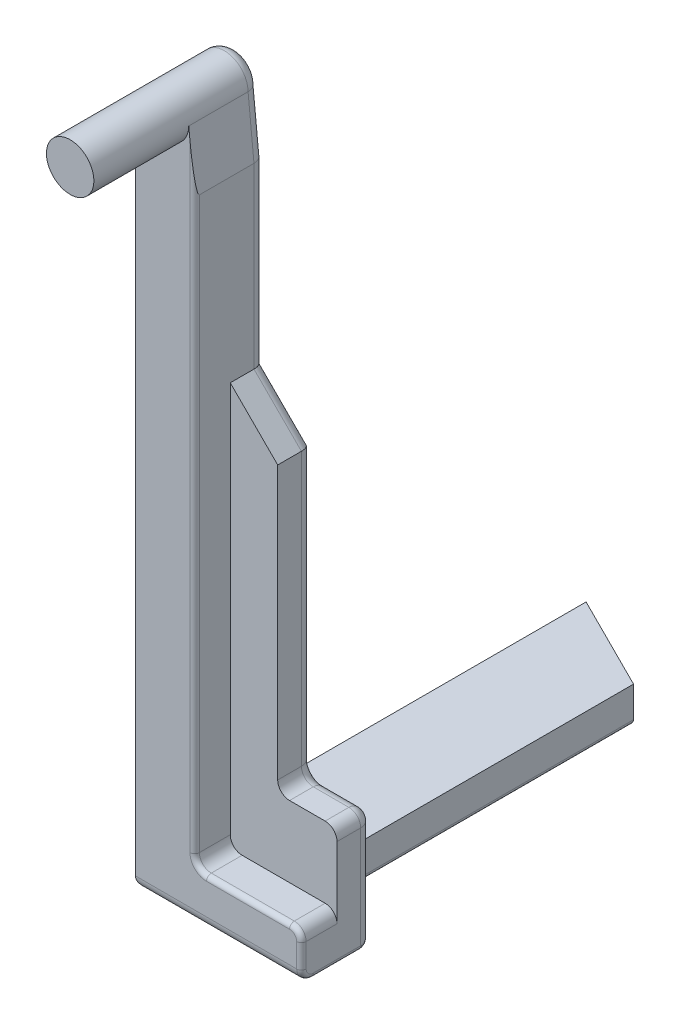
ISO-10303-21;
HEADER;
FILE_DESCRIPTION(('STEP AP214'),'2;1');
FILE_NAME('part.step','',(''),(''),'','','');
FILE_SCHEMA(('AUTOMOTIVE_DESIGN { 1 0 10303 214 1 1 1 1 }'));
ENDSEC;
DATA;
#1=APPLICATION_CONTEXT('core data for automotive mechanical design processes');
#2=APPLICATION_PROTOCOL_DEFINITION('international standard','automotive_design',2000,#1);
#3=PRODUCT_CONTEXT('',#1,'mechanical');
#4=PRODUCT('Part','Part','',(#3));
#5=PRODUCT_RELATED_PRODUCT_CATEGORY('part','',(#4));
#6=PRODUCT_DEFINITION_FORMATION('','',#4);
#7=PRODUCT_DEFINITION_CONTEXT('part definition',#1,'design');
#8=PRODUCT_DEFINITION('design','',#6,#7);
#9=PRODUCT_DEFINITION_SHAPE('','',#8);
#10=(LENGTH_UNIT() NAMED_UNIT(*) SI_UNIT(.MILLI.,.METRE.));
#11=(NAMED_UNIT(*) PLANE_ANGLE_UNIT() SI_UNIT($,.RADIAN.));
#12=(NAMED_UNIT(*) SI_UNIT($,.STERADIAN.) SOLID_ANGLE_UNIT());
#13=UNCERTAINTY_MEASURE_WITH_UNIT(LENGTH_MEASURE(1.E-05),#10,'distance_accuracy_value','');
#14=(GEOMETRIC_REPRESENTATION_CONTEXT(3) GLOBAL_UNCERTAINTY_ASSIGNED_CONTEXT((#13)) GLOBAL_UNIT_ASSIGNED_CONTEXT((#10,
#11,#12)) REPRESENTATION_CONTEXT('',''));
#15=CARTESIAN_POINT('',(0.,0.,0.));
#16=DIRECTION('',(0.,0.,1.));
#17=DIRECTION('',(1.,0.,0.));
#18=AXIS2_PLACEMENT_3D('',#15,#16,#17);
#19=CARTESIAN_POINT('',(-30.,40.,3.));
#20=DIRECTION('',(1.,0.,0.));
#21=DIRECTION('',(0.,1.,0.));
#22=AXIS2_PLACEMENT_3D('',#19,#20,#21);
#23=PLANE('',#22);
#24=DIRECTION('',(0.,0.,1.));
#25=VECTOR('',#24,1.);
#26=CARTESIAN_POINT('',(-30.0000000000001,36.51274724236,0.));
#27=LINE('',#26,#25);
#28=CARTESIAN_POINT('',(-30.0000000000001,36.51274724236,0.5));
#29=VERTEX_POINT('',#28);
#30=CARTESIAN_POINT('',(-30.0000000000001,36.51274724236,3.));
#31=VERTEX_POINT('',#30);
#32=EDGE_CURVE('E423',#29,#31,#27,.T.);
#33=ORIENTED_EDGE('',*,*,#32,.F.);
#34=DIRECTION('',(0.,-1.,0.));
#35=VECTOR('',#34,1.);
#36=CARTESIAN_POINT('',(-30.,40.,0.5));
#37=LINE('',#36,#35);
#38=CARTESIAN_POINT('',(-30.,10.5,0.5));
#39=VERTEX_POINT('',#38);
#40=EDGE_CURVE('E472',#29,#39,#37,.T.);
#41=ORIENTED_EDGE('',*,*,#40,.T.);
#42=DIRECTION('',(0.,0.,-1.));
#43=VECTOR('',#42,1.);
#44=CARTESIAN_POINT('',(-30.,10.5,3.));
#45=LINE('',#44,#43);
#46=CARTESIAN_POINT('',(-30.,10.5,3.));
#47=VERTEX_POINT('',#46);
#48=EDGE_CURVE('E470',#39,#47,#45,.F.);
#49=ORIENTED_EDGE('',*,*,#48,.T.);
#50=DIRECTION('',(0.,-1.,0.));
#51=VECTOR('',#50,1.);
#52=CARTESIAN_POINT('',(-30.,40.,3.));
#53=LINE('',#52,#51);
#54=EDGE_CURVE('E438',#31,#47,#53,.T.);
#55=ORIENTED_EDGE('',*,*,#54,.F.);
#56=EDGE_LOOP('',(#33,#41,#49,#55));
#57=FACE_BOUND('',#56,.T.);
#58=ADVANCED_FACE('F32',(#57),#23,.F.);
#59=CARTESIAN_POINT('',(-30.,10.,3.));
#60=DIRECTION('',(0.,1.,0.));
#61=DIRECTION('',(0.,0.,1.));
#62=AXIS2_PLACEMENT_3D('',#59,#60,#61);
#63=PLANE('',#62);
#64=DIRECTION('',(1.,0.,0.));
#65=VECTOR('',#64,1.);
#66=CARTESIAN_POINT('',(-30.,10.,0.5));
#67=LINE('',#66,#65);
#68=CARTESIAN_POINT('',(-25.7,10.,0.5));
#69=VERTEX_POINT('',#68);
#70=CARTESIAN_POINT('',(-23.2,10.,0.5));
#71=VERTEX_POINT('',#70);
#72=EDGE_CURVE('E477',#69,#71,#67,.T.);
#73=ORIENTED_EDGE('',*,*,#72,.T.);
#74=DIRECTION('',(0.,0.,-1.));
#75=VECTOR('',#74,1.);
#76=CARTESIAN_POINT('',(-23.2,10.,3.));
#77=LINE('',#76,#75);
#78=CARTESIAN_POINT('',(-23.2,10.,2.5));
#79=VERTEX_POINT('',#78);
#80=EDGE_CURVE('E572',#71,#79,#77,.F.);
#81=ORIENTED_EDGE('',*,*,#80,.T.);
#82=DIRECTION('',(1.,0.,0.));
#83=VECTOR('',#82,1.);
#84=CARTESIAN_POINT('',(-30.,10.,2.5));
#85=LINE('',#84,#83);
#86=CARTESIAN_POINT('',(-29.3,10.,2.5));
#87=VERTEX_POINT('',#86);
#88=EDGE_CURVE('E474',#79,#87,#85,.F.);
#89=ORIENTED_EDGE('',*,*,#88,.T.);
#90=DIRECTION('',(0.,0.,-1.));
#91=VECTOR('',#90,1.);
#92=CARTESIAN_POINT('',(-29.3,10.,-10.4688470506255));
#93=LINE('',#92,#91);
#94=CARTESIAN_POINT('',(-29.3,10.,-10.1452402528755));
#95=VERTEX_POINT('',#94);
#96=EDGE_CURVE('E569',#87,#95,#93,.T.);
#97=ORIENTED_EDGE('',*,*,#96,.T.);
#98=DIRECTION('',(-0.894427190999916,0.,-0.447213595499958));
#99=VECTOR('',#98,1.);
#100=CARTESIAN_POINT('',(-27.8632304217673,10.,-9.42685546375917));
#101=LINE('',#100,#99);
#102=CARTESIAN_POINT('',(-27.8613453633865,10.,-9.42591293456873));
#103=VERTEX_POINT('',#102);
#104=EDGE_CURVE('E560',#95,#103,#101,.F.);
#105=ORIENTED_EDGE('',*,*,#104,.T.);
#106=DIRECTION('',(0.447213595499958,0.,-0.894427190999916));
#107=VECTOR('',#106,1.);
#108=CARTESIAN_POINT('',(-33.2594414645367,10.,1.37027926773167));
#109=LINE('',#108,#107);
#110=CARTESIAN_POINT('',(-25.8488841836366,10.,-13.4508352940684));
#111=VERTEX_POINT('',#110);
#112=EDGE_CURVE('E562',#103,#111,#109,.T.);
#113=ORIENTED_EDGE('',*,*,#112,.T.);
#114=DIRECTION('',(0.894427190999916,0.,0.447213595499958));
#115=VECTOR('',#114,1.);
#116=CARTESIAN_POINT('',(-25.5894427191,10.,-13.3211145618));
#117=LINE('',#116,#115);
#118=CARTESIAN_POINT('',(-25.7,10.,-13.37639320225));
#119=VERTEX_POINT('',#118);
#120=EDGE_CURVE('E564',#111,#119,#117,.T.);
#121=ORIENTED_EDGE('',*,*,#120,.T.);
#122=DIRECTION('',(0.,0.,1.));
#123=VECTOR('',#122,1.);
#124=CARTESIAN_POINT('',(-25.7,10.,0.5));
#125=LINE('',#124,#123);
#126=EDGE_CURVE('E566',#119,#69,#125,.T.);
#127=ORIENTED_EDGE('',*,*,#126,.T.);
#128=EDGE_LOOP('',(#73,#81,#89,#97,#105,#113,#121,#127));
#129=FACE_BOUND('',#128,.T.);
#130=ADVANCED_FACE('F622',(#129),#63,.F.);
#131=CARTESIAN_POINT('',(-23.,10.,3.));
#132=DIRECTION('',(-1.,0.,0.));
#133=DIRECTION('',(0.,0.,1.));
#134=AXIS2_PLACEMENT_3D('',#131,#132,#133);
#135=PLANE('',#134);
#136=DIRECTION('',(0.,0.,-1.));
#137=VECTOR('',#136,1.);
#138=CARTESIAN_POINT('',(-23.,11.5,3.));
#139=LINE('',#138,#137);
#140=CARTESIAN_POINT('',(-23.,11.5,1.5));
#141=VERTEX_POINT('',#140);
#142=CARTESIAN_POINT('',(-23.,11.5,2.8));
#143=VERTEX_POINT('',#142);
#144=EDGE_CURVE('E484',#141,#143,#139,.F.);
#145=ORIENTED_EDGE('',*,*,#144,.T.);
#146=DIRECTION('',(0.,1.,0.));
#147=VECTOR('',#146,1.);
#148=CARTESIAN_POINT('',(-23.,10.5,2.8));
#149=LINE('',#148,#147);
#150=CARTESIAN_POINT('',(-23.,10.5,2.8));
#151=VERTEX_POINT('',#150);
#152=EDGE_CURVE('E552',#143,#151,#149,.F.);
#153=ORIENTED_EDGE('',*,*,#152,.T.);
#154=CARTESIAN_POINT('',(-23.,10.5,2.5));
#155=DIRECTION('',(-1.,0.,0.));
#156=DIRECTION('',(0.,0.,1.));
#157=AXIS2_PLACEMENT_3D('',#154,#155,#156);
#158=CIRCLE('',#157,0.3);
#159=CARTESIAN_POINT('',(-23.,10.2,2.5));
#160=VERTEX_POINT('',#159);
#161=EDGE_CURVE('E550',#151,#160,#158,.F.);
#162=ORIENTED_EDGE('',*,*,#161,.T.);
#163=DIRECTION('',(0.,0.,-1.));
#164=VECTOR('',#163,1.);
#165=CARTESIAN_POINT('',(-23.,10.2,3.));
#166=LINE('',#165,#164);
#167=CARTESIAN_POINT('',(-23.,10.2,0.5));
#168=VERTEX_POINT('',#167);
#169=EDGE_CURVE('E548',#160,#168,#166,.T.);
#170=ORIENTED_EDGE('',*,*,#169,.T.);
#171=DIRECTION('',(0.,1.,0.));
#172=VECTOR('',#171,1.);
#173=CARTESIAN_POINT('',(-23.,10.,0.5));
#174=LINE('',#173,#172);
#175=CARTESIAN_POINT('',(-23.,14.5,0.5));
#176=VERTEX_POINT('',#175);
#177=EDGE_CURVE('E482',#168,#176,#174,.T.);
#178=ORIENTED_EDGE('',*,*,#177,.T.);
#179=DIRECTION('',(0.,0.,-1.));
#180=VECTOR('',#179,1.);
#181=CARTESIAN_POINT('',(-23.,14.5,1.5));
#182=LINE('',#181,#180);
#183=CARTESIAN_POINT('',(-23.,14.5,1.5));
#184=VERTEX_POINT('',#183);
#185=EDGE_CURVE('E480',#176,#184,#182,.F.);
#186=ORIENTED_EDGE('',*,*,#185,.T.);
#187=DIRECTION('',(0.,-1.,0.));
#188=VECTOR('',#187,1.);
#189=CARTESIAN_POINT('',(-23.,12.,1.5));
#190=LINE('',#189,#188);
#191=EDGE_CURVE('E409',#184,#141,#190,.T.);
#192=ORIENTED_EDGE('',*,*,#191,.T.);
#193=EDGE_LOOP('',(#145,#153,#162,#170,#178,#186,#192));
#194=FACE_BOUND('',#193,.T.);
#195=ADVANCED_FACE('F627',(#194),#135,.F.);
#196=CARTESIAN_POINT('',(-23.,12.,3.));
#197=DIRECTION('',(0.,-1.,0.));
#198=DIRECTION('',(0.,0.,-1.));
#199=AXIS2_PLACEMENT_3D('',#196,#197,#198);
#200=PLANE('',#199);
#201=DIRECTION('',(0.,0.,-1.));
#202=VECTOR('',#201,1.);
#203=CARTESIAN_POINT('',(-27.,12.,3.));
#204=LINE('',#203,#202);
#205=CARTESIAN_POINT('',(-27.,12.,1.5));
#206=VERTEX_POINT('',#205);
#207=CARTESIAN_POINT('',(-27.,12.,2.8));
#208=VERTEX_POINT('',#207);
#209=EDGE_CURVE('E513',#206,#208,#204,.F.);
#210=ORIENTED_EDGE('',*,*,#209,.T.);
#211=DIRECTION('',(-1.,0.,0.));
#212=VECTOR('',#211,1.);
#213=CARTESIAN_POINT('',(-23.5,12.,2.8));
#214=LINE('',#213,#212);
#215=CARTESIAN_POINT('',(-23.5,12.,2.8));
#216=VERTEX_POINT('',#215);
#217=EDGE_CURVE('E544',#208,#216,#214,.F.);
#218=ORIENTED_EDGE('',*,*,#217,.T.);
#219=DIRECTION('',(0.,0.,-1.));
#220=VECTOR('',#219,1.);
#221=CARTESIAN_POINT('',(-23.5,12.,3.));
#222=LINE('',#221,#220);
#223=CARTESIAN_POINT('',(-23.5,12.,1.5));
#224=VERTEX_POINT('',#223);
#225=EDGE_CURVE('E511',#216,#224,#222,.T.);
#226=ORIENTED_EDGE('',*,*,#225,.T.);
#227=DIRECTION('',(-1.,0.,0.));
#228=VECTOR('',#227,1.);
#229=CARTESIAN_POINT('',(-27.5,12.,1.5));
#230=LINE('',#229,#228);
#231=EDGE_CURVE('E395',#224,#206,#230,.T.);
#232=ORIENTED_EDGE('',*,*,#231,.T.);
#233=EDGE_LOOP('',(#210,#218,#226,#232));
#234=FACE_BOUND('',#233,.T.);
#235=ADVANCED_FACE('F752',(#234),#200,.F.);
#236=CARTESIAN_POINT('',(-27.5,12.,3.));
#237=DIRECTION('',(-1.,0.,0.));
#238=DIRECTION('',(0.,-1.,0.));
#239=AXIS2_PLACEMENT_3D('',#236,#237,#238);
#240=PLANE('',#239);
#241=DIRECTION('',(0.,0.,1.));
#242=VECTOR('',#241,1.);
#243=CARTESIAN_POINT('',(-27.5,36.5127472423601,0.));
#244=LINE('',#243,#242);
#245=CARTESIAN_POINT('',(-27.5,36.5127472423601,0.5));
#246=VERTEX_POINT('',#245);
#247=CARTESIAN_POINT('',(-27.5,36.5127472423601,2.8));
#248=VERTEX_POINT('',#247);
#249=EDGE_CURVE('E424',#246,#248,#244,.T.);
#250=ORIENTED_EDGE('',*,*,#249,.T.);
#251=DIRECTION('',(0.,1.,0.));
#252=VECTOR('',#251,1.);
#253=CARTESIAN_POINT('',(-27.5,12.5,2.8));
#254=LINE('',#253,#252);
#255=CARTESIAN_POINT('',(-27.5,12.5,2.8));
#256=VERTEX_POINT('',#255);
#257=EDGE_CURVE('E540',#248,#256,#254,.F.);
#258=ORIENTED_EDGE('',*,*,#257,.T.);
#259=DIRECTION('',(0.,0.,-1.));
#260=VECTOR('',#259,1.);
#261=CARTESIAN_POINT('',(-27.5,12.5,1.5));
#262=LINE('',#261,#260);
#263=CARTESIAN_POINT('',(-27.5,12.5,1.5));
#264=VERTEX_POINT('',#263);
#265=EDGE_CURVE('E499',#256,#264,#262,.T.);
#266=ORIENTED_EDGE('',*,*,#265,.T.);
#267=DIRECTION('',(0.,1.,0.));
#268=VECTOR('',#267,1.);
#269=CARTESIAN_POINT('',(-27.5,29.,1.5));
#270=LINE('',#269,#268);
#271=CARTESIAN_POINT('',(-27.5,29.,1.5));
#272=VERTEX_POINT('',#271);
#273=EDGE_CURVE('E398',#264,#272,#270,.T.);
#274=ORIENTED_EDGE('',*,*,#273,.T.);
#275=DIRECTION('',(0.,0.,-1.));
#276=VECTOR('',#275,1.);
#277=CARTESIAN_POINT('',(-27.5,29.,1.5));
#278=LINE('',#277,#276);
#279=CARTESIAN_POINT('',(-27.5,29.,0.5));
#280=VERTEX_POINT('',#279);
#281=EDGE_CURVE('E411',#272,#280,#278,.T.);
#282=ORIENTED_EDGE('',*,*,#281,.T.);
#283=DIRECTION('',(0.,1.,0.));
#284=VECTOR('',#283,1.);
#285=CARTESIAN_POINT('',(-27.5,12.,0.5));
#286=LINE('',#285,#284);
#287=EDGE_CURVE('E501',#280,#246,#286,.T.);
#288=ORIENTED_EDGE('',*,*,#287,.T.);
#289=EDGE_LOOP('',(#250,#258,#266,#274,#282,#288));
#290=FACE_BOUND('',#289,.T.);
#291=ADVANCED_FACE('F749',(#290),#240,.F.);
#292=CARTESIAN_POINT('',(-30.,40.,3.));
#293=DIRECTION('',(0.,0.,1.));
#294=DIRECTION('',(1.,0.,0.));
#295=AXIS2_PLACEMENT_3D('',#292,#293,#294);
#296=PLANE('',#295);
#297=CARTESIAN_POINT('',(-27.,12.5,3.));
#298=DIRECTION('',(0.,0.,1.));
#299=DIRECTION('',(1.,0.,0.));
#300=AXIS2_PLACEMENT_3D('',#297,#298,#299);
#301=CIRCLE('',#300,0.7);
#302=CARTESIAN_POINT('',(-27.,11.8,3.));
#303=VERTEX_POINT('',#302);
#304=CARTESIAN_POINT('',(-27.7,12.5,3.));
#305=VERTEX_POINT('',#304);
#306=EDGE_CURVE('E533',#303,#305,#301,.F.);
#307=ORIENTED_EDGE('',*,*,#306,.T.);
#308=DIRECTION('',(0.,1.,0.));
#309=VECTOR('',#308,1.);
#310=CARTESIAN_POINT('',(-27.7,36.5127472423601,3.));
#311=LINE('',#310,#309);
#312=CARTESIAN_POINT('',(-27.7,38.502549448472,3.));
#313=VERTEX_POINT('',#312);
#314=EDGE_CURVE('E535',#305,#313,#311,.T.);
#315=ORIENTED_EDGE('',*,*,#314,.T.);
#316=DIRECTION('',(0.100008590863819,-0.994986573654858,0.));
#317=VECTOR('',#316,1.);
#318=CARTESIAN_POINT('',(-27.75,39.,3.));
#319=LINE('',#318,#317);
#320=CARTESIAN_POINT('',(-27.75,39.,3.));
#321=VERTEX_POINT('',#320);
#322=EDGE_CURVE('E420',#321,#313,#319,.T.);
#323=ORIENTED_EDGE('',*,*,#322,.F.);
#324=CARTESIAN_POINT('',(-28.75,39.,3.));
#325=DIRECTION('',(0.,0.,1.));
#326=DIRECTION('',(1.,0.,0.));
#327=AXIS2_PLACEMENT_3D('',#324,#325,#326);
#328=CIRCLE('',#327,1.);
#329=CARTESIAN_POINT('',(-29.75,39.,3.));
#330=VERTEX_POINT('',#329);
#331=EDGE_CURVE('E427',#330,#321,#328,.T.);
#332=ORIENTED_EDGE('',*,*,#331,.F.);
#333=DIRECTION('',(0.100008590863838,0.994986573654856,0.));
#334=VECTOR('',#333,1.);
#335=CARTESIAN_POINT('',(-29.75,39.,3.));
#336=LINE('',#335,#334);
#337=EDGE_CURVE('E415',#31,#330,#336,.T.);
#338=ORIENTED_EDGE('',*,*,#337,.F.);
#339=ORIENTED_EDGE('',*,*,#54,.T.);
#340=DIRECTION('',(1.,0.,0.));
#341=VECTOR('',#340,1.);
#342=CARTESIAN_POINT('',(-23.,10.5,3.));
#343=LINE('',#342,#341);
#344=CARTESIAN_POINT('',(-23.2,10.5,3.));
#345=VERTEX_POINT('',#344);
#346=EDGE_CURVE('E516',#47,#345,#343,.T.);
#347=ORIENTED_EDGE('',*,*,#346,.T.);
#348=DIRECTION('',(0.,1.,0.));
#349=VECTOR('',#348,1.);
#350=CARTESIAN_POINT('',(-23.2,11.5,3.));
#351=LINE('',#350,#349);
#352=CARTESIAN_POINT('',(-23.2,11.5,3.));
#353=VERTEX_POINT('',#352);
#354=EDGE_CURVE('E288',#345,#353,#351,.T.);
#355=ORIENTED_EDGE('',*,*,#354,.T.);
#356=CARTESIAN_POINT('',(-23.5,11.5,3.));
#357=DIRECTION('',(0.,0.,1.));
#358=DIRECTION('',(1.,0.,0.));
#359=AXIS2_PLACEMENT_3D('',#356,#357,#358);
#360=CIRCLE('',#359,0.3);
#361=CARTESIAN_POINT('',(-23.5,11.8,3.));
#362=VERTEX_POINT('',#361);
#363=EDGE_CURVE('E529',#353,#362,#360,.T.);
#364=ORIENTED_EDGE('',*,*,#363,.T.);
#365=DIRECTION('',(-1.,0.,0.));
#366=VECTOR('',#365,1.);
#367=CARTESIAN_POINT('',(-27.,11.8,3.));
#368=LINE('',#367,#366);
#369=EDGE_CURVE('E531',#362,#303,#368,.T.);
#370=ORIENTED_EDGE('',*,*,#369,.T.);
#371=EDGE_LOOP('',(#307,#315,#323,#332,#338,#339,#347,#355,#364,#370));
#372=FACE_BOUND('',#371,.T.);
#373=ADVANCED_FACE('F639',(#372),#296,.T.);
#374=CARTESIAN_POINT('',(-30.,40.,0.));
#375=DIRECTION('',(0.,0.,1.));
#376=DIRECTION('',(1.,0.,0.));
#377=AXIS2_PLACEMENT_3D('',#374,#375,#376);
#378=PLANE('',#377);
#379=DIRECTION('',(1.,0.,0.));
#380=VECTOR('',#379,1.);
#381=CARTESIAN_POINT('',(-30.,10.5,0.));
#382=LINE('',#381,#380);
#383=CARTESIAN_POINT('',(-23.5,10.5,0.));
#384=VERTEX_POINT('',#383);
#385=CARTESIAN_POINT('',(-25.5,10.5,0.));
#386=VERTEX_POINT('',#385);
#387=EDGE_CURVE('E462',#384,#386,#382,.F.);
#388=ORIENTED_EDGE('',*,*,#387,.T.);
#389=DIRECTION('',(0.,1.,0.));
#390=VECTOR('',#389,1.);
#391=CARTESIAN_POINT('',(-25.5,40.,0.));
#392=LINE('',#391,#390);
#393=CARTESIAN_POINT('',(-25.5,11.5,0.));
#394=VERTEX_POINT('',#393);
#395=EDGE_CURVE('E324',#386,#394,#392,.T.);
#396=ORIENTED_EDGE('',*,*,#395,.T.);
#397=DIRECTION('',(-1.,0.,0.));
#398=VECTOR('',#397,1.);
#399=CARTESIAN_POINT('',(-30.,11.5,0.));
#400=LINE('',#399,#398);
#401=CARTESIAN_POINT('',(-29.5,11.5,0.));
#402=VERTEX_POINT('',#401);
#403=EDGE_CURVE('E321',#394,#402,#400,.T.);
#404=ORIENTED_EDGE('',*,*,#403,.T.);
#405=DIRECTION('',(0.,-1.,0.));
#406=VECTOR('',#405,1.);
#407=CARTESIAN_POINT('',(-29.5,40.,0.));
#408=LINE('',#407,#406);
#409=CARTESIAN_POINT('',(-29.5,36.4876822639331,0.));
#410=VERTEX_POINT('',#409);
#411=EDGE_CURVE('E465',#402,#410,#408,.F.);
#412=ORIENTED_EDGE('',*,*,#411,.T.);
#413=DIRECTION('',(0.100008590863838,0.994986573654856,0.));
#414=VECTOR('',#413,1.);
#415=CARTESIAN_POINT('',(-29.1554999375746,39.9151171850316,0.));
#416=LINE('',#415,#414);
#417=CARTESIAN_POINT('',(-29.249568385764,38.9792291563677,0.));
#418=VERTEX_POINT('',#417);
#419=EDGE_CURVE('E451',#410,#418,#416,.T.);
#420=ORIENTED_EDGE('',*,*,#419,.T.);
#421=CARTESIAN_POINT('',(-28.75,39.,0.));
#422=DIRECTION('',(0.,0.,1.));
#423=DIRECTION('',(1.,0.,0.));
#424=AXIS2_PLACEMENT_3D('',#421,#422,#423);
#425=CIRCLE('',#424,0.500000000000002);
#426=CARTESIAN_POINT('',(-28.250431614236,38.9792291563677,0.));
#427=VERTEX_POINT('',#426);
#428=EDGE_CURVE('E441',#418,#427,#425,.F.);
#429=ORIENTED_EDGE('',*,*,#428,.T.);
#430=DIRECTION('',(0.100008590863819,-0.994986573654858,0.));
#431=VECTOR('',#430,1.);
#432=CARTESIAN_POINT('',(-28.3695043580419,40.1638851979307,0.));
#433=LINE('',#432,#431);
#434=CARTESIAN_POINT('',(-28.,36.4876822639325,0.));
#435=VERTEX_POINT('',#434);
#436=EDGE_CURVE('E443',#427,#435,#433,.T.);
#437=ORIENTED_EDGE('',*,*,#436,.T.);
#438=DIRECTION('',(0.,1.,0.));
#439=VECTOR('',#438,1.);
#440=CARTESIAN_POINT('',(-28.,40.,0.));
#441=LINE('',#440,#439);
#442=CARTESIAN_POINT('',(-28.,28.7928932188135,0.));
#443=VERTEX_POINT('',#442);
#444=EDGE_CURVE('E445',#435,#443,#441,.F.);
#445=ORIENTED_EDGE('',*,*,#444,.T.);
#446=DIRECTION('',(0.707106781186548,-0.707106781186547,0.));
#447=VECTOR('',#446,1.);
#448=CARTESIAN_POINT('',(-25.8535533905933,26.6464466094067,0.));
#449=LINE('',#448,#447);
#450=CARTESIAN_POINT('',(-26.,26.7928932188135,0.));
#451=VERTEX_POINT('',#450);
#452=EDGE_CURVE('E447',#443,#451,#449,.T.);
#453=ORIENTED_EDGE('',*,*,#452,.T.);
#454=DIRECTION('',(0.,-1.,0.));
#455=VECTOR('',#454,1.);
#456=CARTESIAN_POINT('',(-26.,15.,0.));
#457=LINE('',#456,#455);
#458=CARTESIAN_POINT('',(-26.,15.5,0.));
#459=VERTEX_POINT('',#458);
#460=EDGE_CURVE('E449',#451,#459,#457,.T.);
#461=ORIENTED_EDGE('',*,*,#460,.T.);
#462=CARTESIAN_POINT('',(-25.,15.5,0.));
#463=DIRECTION('',(0.,0.,1.));
#464=DIRECTION('',(1.,0.,0.));
#465=AXIS2_PLACEMENT_3D('',#462,#463,#464);
#466=CIRCLE('',#465,1.);
#467=CARTESIAN_POINT('',(-25.,14.5,0.));
#468=VERTEX_POINT('',#467);
#469=EDGE_CURVE('E454',#468,#459,#466,.F.);
#470=ORIENTED_EDGE('',*,*,#469,.F.);
#471=DIRECTION('',(1.,0.,0.));
#472=VECTOR('',#471,1.);
#473=CARTESIAN_POINT('',(-23.,14.5,0.));
#474=LINE('',#473,#472);
#475=CARTESIAN_POINT('',(-23.5,14.5,0.));
#476=VERTEX_POINT('',#475);
#477=EDGE_CURVE('E457',#468,#476,#474,.T.);
#478=ORIENTED_EDGE('',*,*,#477,.T.);
#479=DIRECTION('',(0.,1.,0.));
#480=VECTOR('',#479,1.);
#481=CARTESIAN_POINT('',(-23.5,40.,0.));
#482=LINE('',#481,#480);
#483=EDGE_CURVE('E459',#476,#384,#482,.F.);
#484=ORIENTED_EDGE('',*,*,#483,.T.);
#485=EDGE_LOOP('',(#388,#396,#404,#412,#420,#429,#437,#445,#453,#461,#470,#478,#484));
#486=FACE_BOUND('',#485,.T.);
#487=ADVANCED_FACE('F654',(#486),#378,.F.);
#488=CARTESIAN_POINT('',(-28.75,39.,7.));
#489=DIRECTION('',(0.,0.,-1.));
#490=DIRECTION('',(-1.,0.,0.));
#491=AXIS2_PLACEMENT_3D('',#488,#489,#490);
#492=CYLINDRICAL_SURFACE('',#491,1.);
#493=DIRECTION('',(0.,0.,1.));
#494=VECTOR('',#493,1.);
#495=CARTESIAN_POINT('',(-27.75,39.,0.));
#496=LINE('',#495,#494);
#497=CARTESIAN_POINT('',(-27.75,39.,0.5));
#498=VERTEX_POINT('',#497);
#499=EDGE_CURVE('E428',#498,#321,#496,.T.);
#500=ORIENTED_EDGE('',*,*,#499,.F.);
#501=CARTESIAN_POINT('',(-28.75,39.,0.5));
#502=DIRECTION('',(0.,0.,1.));
#503=DIRECTION('',(1.,0.,0.));
#504=AXIS2_PLACEMENT_3D('',#501,#502,#503);
#505=CIRCLE('',#504,1.);
#506=CARTESIAN_POINT('',(-29.75,39.,0.5));
#507=VERTEX_POINT('',#506);
#508=EDGE_CURVE('E505',#498,#507,#505,.T.);
#509=ORIENTED_EDGE('',*,*,#508,.T.);
#510=DIRECTION('',(0.,0.,1.));
#511=VECTOR('',#510,1.);
#512=CARTESIAN_POINT('',(-29.75,39.,0.));
#513=LINE('',#512,#511);
#514=EDGE_CURVE('E430',#507,#330,#513,.T.);
#515=ORIENTED_EDGE('',*,*,#514,.T.);
#516=ORIENTED_EDGE('',*,*,#331,.T.);
#517=EDGE_LOOP('',(#500,#509,#515,#516));
#518=FACE_BOUND('',#517,.T.);
#519=CARTESIAN_POINT('',(-28.75,39.,7.));
#520=DIRECTION('',(0.,0.,1.));
#521=DIRECTION('',(1.,0.,0.));
#522=AXIS2_PLACEMENT_3D('',#519,#520,#521);
#523=CIRCLE('',#522,1.);
#524=CARTESIAN_POINT('',(-27.75,39.,7.));
#525=VERTEX_POINT('',#524);
#526=EDGE_CURVE('E435',#525,#525,#523,.T.);
#527=ORIENTED_EDGE('',*,*,#526,.F.);
#528=EDGE_LOOP('',(#527));
#529=FACE_BOUND('',#528,.T.);
#530=ADVANCED_FACE('F643',(#518,#529),#492,.T.);
#531=CARTESIAN_POINT('',(-28.75,39.,7.));
#532=DIRECTION('',(0.,0.,1.));
#533=DIRECTION('',(1.,0.,0.));
#534=AXIS2_PLACEMENT_3D('',#531,#532,#533);
#535=PLANE('',#534);
#536=ORIENTED_EDGE('',*,*,#526,.T.);
#537=EDGE_LOOP('',(#536));
#538=FACE_BOUND('',#537,.T.);
#539=ADVANCED_FACE('F736',(#538),#535,.T.);
#540=CARTESIAN_POINT('',(-27.75,39.,0.));
#541=DIRECTION('',(-0.994986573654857,-0.100008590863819,0.));
#542=DIRECTION('',(0.100008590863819,-0.994986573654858,0.));
#543=AXIS2_PLACEMENT_3D('',#540,#541,#542);
#544=PLANE('',#543);
#545=ORIENTED_EDGE('',*,*,#322,.T.);
#546=CARTESIAN_POINT('',(-27.7,38.502549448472,2.8));
#547=DIRECTION('',(-0.994986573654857,-0.100008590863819,0.));
#548=DIRECTION('',(0.100008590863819,-0.994986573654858,0.));
#549=AXIS2_PLACEMENT_3D('',#546,#547,#548);
#550=ELLIPSE('',#549,1.99982819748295,0.2);
#551=EDGE_CURVE('E538',#313,#248,#550,.F.);
#552=ORIENTED_EDGE('',*,*,#551,.T.);
#553=ORIENTED_EDGE('',*,*,#249,.F.);
#554=DIRECTION('',(0.100008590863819,-0.994986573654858,0.));
#555=VECTOR('',#554,1.);
#556=CARTESIAN_POINT('',(-27.75,39.,0.5));
#557=LINE('',#556,#555);
#558=EDGE_CURVE('E503',#246,#498,#557,.F.);
#559=ORIENTED_EDGE('',*,*,#558,.T.);
#560=ORIENTED_EDGE('',*,*,#499,.T.);
#561=EDGE_LOOP('',(#545,#552,#553,#559,#560));
#562=FACE_BOUND('',#561,.T.);
#563=ADVANCED_FACE('F733',(#562),#544,.F.);
#564=CARTESIAN_POINT('',(-29.75,39.,0.));
#565=DIRECTION('',(0.994986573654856,-0.100008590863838,0.));
#566=DIRECTION('',(0.100008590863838,0.994986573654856,0.));
#567=AXIS2_PLACEMENT_3D('',#564,#565,#566);
#568=PLANE('',#567);
#569=ORIENTED_EDGE('',*,*,#514,.F.);
#570=DIRECTION('',(0.100008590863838,0.994986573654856,0.));
#571=VECTOR('',#570,1.);
#572=CARTESIAN_POINT('',(-29.75,39.,0.5));
#573=LINE('',#572,#571);
#574=EDGE_CURVE('E467',#507,#29,#573,.F.);
#575=ORIENTED_EDGE('',*,*,#574,.T.);
#576=ORIENTED_EDGE('',*,*,#32,.T.);
#577=ORIENTED_EDGE('',*,*,#337,.T.);
#578=EDGE_LOOP('',(#569,#575,#576,#577));
#579=FACE_BOUND('',#578,.T.);
#580=ADVANCED_FACE('F635',(#579),#568,.F.);
#581=CARTESIAN_POINT('',(-23.,15.,1.5));
#582=DIRECTION('',(0.,1.,0.));
#583=DIRECTION('',(0.,0.,1.));
#584=AXIS2_PLACEMENT_3D('',#581,#582,#583);
#585=PLANE('',#584);
#586=DIRECTION('',(1.,0.,0.));
#587=VECTOR('',#586,1.);
#588=CARTESIAN_POINT('',(-25.5,15.,0.5));
#589=LINE('',#588,#587);
#590=CARTESIAN_POINT('',(-23.5,15.,0.5));
#591=VERTEX_POINT('',#590);
#592=CARTESIAN_POINT('',(-25.,15.,0.5));
#593=VERTEX_POINT('',#592);
#594=EDGE_CURVE('E489',#591,#593,#589,.F.);
#595=ORIENTED_EDGE('',*,*,#594,.T.);
#596=DIRECTION('',(0.,0.,-1.));
#597=VECTOR('',#596,1.);
#598=CARTESIAN_POINT('',(-25.,15.,1.5));
#599=LINE('',#598,#597);
#600=CARTESIAN_POINT('',(-25.,15.,1.5));
#601=VERTEX_POINT('',#600);
#602=EDGE_CURVE('E491',#593,#601,#599,.F.);
#603=ORIENTED_EDGE('',*,*,#602,.T.);
#604=DIRECTION('',(1.,0.,0.));
#605=VECTOR('',#604,1.);
#606=CARTESIAN_POINT('',(-23.,15.,1.5));
#607=LINE('',#606,#605);
#608=CARTESIAN_POINT('',(-23.5,15.,1.5));
#609=VERTEX_POINT('',#608);
#610=EDGE_CURVE('E406',#601,#609,#607,.T.);
#611=ORIENTED_EDGE('',*,*,#610,.T.);
#612=DIRECTION('',(0.,0.,-1.));
#613=VECTOR('',#612,1.);
#614=CARTESIAN_POINT('',(-23.5,15.,0.));
#615=LINE('',#614,#613);
#616=EDGE_CURVE('E487',#609,#591,#615,.T.);
#617=ORIENTED_EDGE('',*,*,#616,.T.);
#618=EDGE_LOOP('',(#595,#603,#611,#617));
#619=FACE_BOUND('',#618,.T.);
#620=ADVANCED_FACE('F722',(#619),#585,.T.);
#621=CARTESIAN_POINT('',(-25.5,15.,1.5));
#622=DIRECTION('',(1.,0.,0.));
#623=DIRECTION('',(0.,0.,-1.));
#624=AXIS2_PLACEMENT_3D('',#621,#622,#623);
#625=PLANE('',#624);
#626=DIRECTION('',(0.,0.,-1.));
#627=VECTOR('',#626,1.);
#628=CARTESIAN_POINT('',(-25.5,15.5,0.));
#629=LINE('',#628,#627);
#630=CARTESIAN_POINT('',(-25.5,15.5,1.5));
#631=VERTEX_POINT('',#630);
#632=CARTESIAN_POINT('',(-25.5,15.5,0.5));
#633=VERTEX_POINT('',#632);
#634=EDGE_CURVE('E493',#631,#633,#629,.T.);
#635=ORIENTED_EDGE('',*,*,#634,.T.);
#636=DIRECTION('',(0.,-1.,0.));
#637=VECTOR('',#636,1.);
#638=CARTESIAN_POINT('',(-25.5,27.,0.5));
#639=LINE('',#638,#637);
#640=CARTESIAN_POINT('',(-25.5,27.,0.5));
#641=VERTEX_POINT('',#640);
#642=EDGE_CURVE('E495',#633,#641,#639,.F.);
#643=ORIENTED_EDGE('',*,*,#642,.T.);
#644=DIRECTION('',(0.,0.,-1.));
#645=VECTOR('',#644,1.);
#646=CARTESIAN_POINT('',(-25.5,27.,1.5));
#647=LINE('',#646,#645);
#648=CARTESIAN_POINT('',(-25.5,27.,1.5));
#649=VERTEX_POINT('',#648);
#650=EDGE_CURVE('E412',#649,#641,#647,.T.);
#651=ORIENTED_EDGE('',*,*,#650,.F.);
#652=DIRECTION('',(0.,-1.,0.));
#653=VECTOR('',#652,1.);
#654=CARTESIAN_POINT('',(-25.5,15.,1.5));
#655=LINE('',#654,#653);
#656=EDGE_CURVE('E403',#649,#631,#655,.T.);
#657=ORIENTED_EDGE('',*,*,#656,.T.);
#658=EDGE_LOOP('',(#635,#643,#651,#657));
#659=FACE_BOUND('',#658,.T.);
#660=ADVANCED_FACE('F725',(#659),#625,.T.);
#661=CARTESIAN_POINT('',(-25.5,27.,1.5));
#662=DIRECTION('',(0.707106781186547,0.707106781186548,0.));
#663=DIRECTION('',(-0.707106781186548,0.707106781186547,0.));
#664=AXIS2_PLACEMENT_3D('',#661,#662,#663);
#665=PLANE('',#664);
#666=ORIENTED_EDGE('',*,*,#650,.T.);
#667=DIRECTION('',(0.707106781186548,-0.707106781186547,0.));
#668=VECTOR('',#667,1.);
#669=CARTESIAN_POINT('',(-27.5,29.,0.5));
#670=LINE('',#669,#668);
#671=EDGE_CURVE('E497',#641,#280,#670,.F.);
#672=ORIENTED_EDGE('',*,*,#671,.T.);
#673=ORIENTED_EDGE('',*,*,#281,.F.);
#674=DIRECTION('',(0.707106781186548,-0.707106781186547,0.));
#675=VECTOR('',#674,1.);
#676=CARTESIAN_POINT('',(-25.5,27.,1.5));
#677=LINE('',#676,#675);
#678=EDGE_CURVE('E400',#272,#649,#677,.T.);
#679=ORIENTED_EDGE('',*,*,#678,.T.);
#680=EDGE_LOOP('',(#666,#672,#673,#679));
#681=FACE_BOUND('',#680,.T.);
#682=ADVANCED_FACE('F720',(#681),#665,.T.);
#683=CARTESIAN_POINT('',(-23.,12.,1.5));
#684=DIRECTION('',(0.,0.,1.));
#685=DIRECTION('',(1.,0.,0.));
#686=AXIS2_PLACEMENT_3D('',#683,#684,#685);
#687=PLANE('',#686);
#688=ORIENTED_EDGE('',*,*,#273,.F.);
#689=CARTESIAN_POINT('',(-27.,12.5,1.5));
#690=DIRECTION('',(0.,0.,1.));
#691=DIRECTION('',(1.,0.,0.));
#692=AXIS2_PLACEMENT_3D('',#689,#690,#691);
#693=CIRCLE('',#692,0.5);
#694=EDGE_CURVE('E509',#264,#206,#693,.T.);
#695=ORIENTED_EDGE('',*,*,#694,.T.);
#696=ORIENTED_EDGE('',*,*,#231,.F.);
#697=CARTESIAN_POINT('',(-23.5,11.5,1.5));
#698=DIRECTION('',(0.,0.,1.));
#699=DIRECTION('',(1.,0.,0.));
#700=AXIS2_PLACEMENT_3D('',#697,#698,#699);
#701=CIRCLE('',#700,0.5);
#702=EDGE_CURVE('E521',#224,#141,#701,.F.);
#703=ORIENTED_EDGE('',*,*,#702,.T.);
#704=ORIENTED_EDGE('',*,*,#191,.F.);
#705=CARTESIAN_POINT('',(-23.5,14.5,1.5));
#706=DIRECTION('',(0.,0.,1.));
#707=DIRECTION('',(1.,0.,0.));
#708=AXIS2_PLACEMENT_3D('',#705,#706,#707);
#709=CIRCLE('',#708,0.5);
#710=EDGE_CURVE('E507',#184,#609,#709,.T.);
#711=ORIENTED_EDGE('',*,*,#710,.T.);
#712=ORIENTED_EDGE('',*,*,#610,.F.);
#713=CARTESIAN_POINT('',(-25.,15.5,1.5));
#714=DIRECTION('',(0.,0.,1.));
#715=DIRECTION('',(1.,0.,0.));
#716=AXIS2_PLACEMENT_3D('',#713,#714,#715);
#717=CIRCLE('',#716,0.5);
#718=EDGE_CURVE('E519',#601,#631,#717,.F.);
#719=ORIENTED_EDGE('',*,*,#718,.T.);
#720=ORIENTED_EDGE('',*,*,#656,.F.);
#721=ORIENTED_EDGE('',*,*,#678,.F.);
#722=EDGE_LOOP('',(#688,#695,#696,#703,#704,#711,#712,#719,#720,#721));
#723=FACE_BOUND('',#722,.T.);
#724=ADVANCED_FACE('F716',(#723),#687,.T.);
#725=CARTESIAN_POINT('',(-25.,15.5,1.5));
#726=DIRECTION('',(0.,0.,1.));
#727=DIRECTION('',(1.,0.,0.));
#728=AXIS2_PLACEMENT_3D('',#725,#726,#727);
#729=CYLINDRICAL_SURFACE('',#728,0.5);
#730=ORIENTED_EDGE('',*,*,#718,.F.);
#731=ORIENTED_EDGE('',*,*,#602,.F.);
#732=CARTESIAN_POINT('',(-25.,15.5,0.5));
#733=DIRECTION('',(0.,0.,1.));
#734=DIRECTION('',(1.,0.,0.));
#735=AXIS2_PLACEMENT_3D('',#732,#733,#734);
#736=CIRCLE('',#735,0.5);
#737=EDGE_CURVE('E389',#633,#593,#736,.T.);
#738=ORIENTED_EDGE('',*,*,#737,.F.);
#739=ORIENTED_EDGE('',*,*,#634,.F.);
#740=EDGE_LOOP('',(#730,#731,#738,#739));
#741=FACE_BOUND('',#740,.T.);
#742=ADVANCED_FACE('F712',(#741),#729,.F.);
#743=CARTESIAN_POINT('',(-23.5,14.5,1.5));
#744=DIRECTION('',(0.,0.,1.));
#745=DIRECTION('',(1.,0.,0.));
#746=AXIS2_PLACEMENT_3D('',#743,#744,#745);
#747=CYLINDRICAL_SURFACE('',#746,0.5);
#748=ORIENTED_EDGE('',*,*,#710,.F.);
#749=ORIENTED_EDGE('',*,*,#185,.F.);
#750=CARTESIAN_POINT('',(-23.5,14.5,0.5));
#751=DIRECTION('',(0.,0.,-1.));
#752=DIRECTION('',(-1.,0.,0.));
#753=AXIS2_PLACEMENT_3D('',#750,#751,#752);
#754=CIRCLE('',#753,0.5);
#755=EDGE_CURVE('E386',#591,#176,#754,.T.);
#756=ORIENTED_EDGE('',*,*,#755,.F.);
#757=ORIENTED_EDGE('',*,*,#616,.F.);
#758=EDGE_LOOP('',(#748,#749,#756,#757));
#759=FACE_BOUND('',#758,.T.);
#760=ADVANCED_FACE('F708',(#759),#747,.T.);
#761=CARTESIAN_POINT('',(-30.,14.5,0.5));
#762=DIRECTION('',(-1.,0.,0.));
#763=DIRECTION('',(0.,0.,1.));
#764=AXIS2_PLACEMENT_3D('',#761,#762,#763);
#765=CYLINDRICAL_SURFACE('',#764,0.5);
#766=CARTESIAN_POINT('',(-23.5,14.5,0.5));
#767=DIRECTION('',(1.,0.,0.));
#768=DIRECTION('',(0.,0.,-1.));
#769=AXIS2_PLACEMENT_3D('',#766,#767,#768);
#770=CIRCLE('',#769,0.5);
#771=EDGE_CURVE('E383',#476,#591,#770,.T.);
#772=ORIENTED_EDGE('',*,*,#771,.F.);
#773=ORIENTED_EDGE('',*,*,#477,.F.);
#774=CARTESIAN_POINT('',(-25.,14.5,0.5));
#775=DIRECTION('',(-1.,0.,0.));
#776=DIRECTION('',(0.,0.,1.));
#777=AXIS2_PLACEMENT_3D('',#774,#775,#776);
#778=CIRCLE('',#777,0.5);
#779=EDGE_CURVE('E392',#593,#468,#778,.T.);
#780=ORIENTED_EDGE('',*,*,#779,.F.);
#781=ORIENTED_EDGE('',*,*,#594,.F.);
#782=EDGE_LOOP('',(#772,#773,#780,#781));
#783=FACE_BOUND('',#782,.T.);
#784=ADVANCED_FACE('F704',(#783),#765,.T.);
#785=CARTESIAN_POINT('',(-25.,15.5,0.5));
#786=DIRECTION('',(0.,0.,1.));
#787=DIRECTION('',(1.,0.,0.));
#788=AXIS2_PLACEMENT_3D('',#785,#786,#787);
#789=TOROIDAL_SURFACE('',#788,1.,0.5);
#790=ORIENTED_EDGE('',*,*,#779,.T.);
#791=ORIENTED_EDGE('',*,*,#469,.T.);
#792=CARTESIAN_POINT('',(-26.,15.5,0.5));
#793=DIRECTION('',(0.,-1.,0.));
#794=DIRECTION('',(0.,0.,-1.));
#795=AXIS2_PLACEMENT_3D('',#792,#793,#794);
#796=CIRCLE('',#795,0.5);
#797=EDGE_CURVE('E380',#633,#459,#796,.F.);
#798=ORIENTED_EDGE('',*,*,#797,.F.);
#799=ORIENTED_EDGE('',*,*,#737,.T.);
#800=EDGE_LOOP('',(#790,#791,#798,#799));
#801=FACE_BOUND('',#800,.T.);
#802=ADVANCED_FACE('F700',(#801),#789,.T.);
#803=CARTESIAN_POINT('',(-23.5,14.5,0.5));
#804=DIRECTION('',(0.,0.,1.));
#805=DIRECTION('',(1.,0.,0.));
#806=AXIS2_PLACEMENT_3D('',#803,#804,#805);
#807=SPHERICAL_SURFACE('',#806,0.5);
#808=ORIENTED_EDGE('',*,*,#771,.T.);
#809=ORIENTED_EDGE('',*,*,#755,.T.);
#810=CARTESIAN_POINT('',(-23.5,14.5,0.5));
#811=DIRECTION('',(0.,1.,0.));
#812=DIRECTION('',(0.,0.,1.));
#813=AXIS2_PLACEMENT_3D('',#810,#811,#812);
#814=CIRCLE('',#813,0.5);
#815=EDGE_CURVE('E377',#476,#176,#814,.F.);
#816=ORIENTED_EDGE('',*,*,#815,.F.);
#817=EDGE_LOOP('',(#808,#809,#816));
#818=FACE_BOUND('',#817,.T.);
#819=ADVANCED_FACE('F696',(#818),#807,.T.);
#820=CARTESIAN_POINT('',(-26.,40.,0.5));
#821=DIRECTION('',(0.,1.,0.));
#822=DIRECTION('',(0.,0.,1.));
#823=AXIS2_PLACEMENT_3D('',#820,#821,#822);
#824=CYLINDRICAL_SURFACE('',#823,0.5);
#825=ORIENTED_EDGE('',*,*,#797,.T.);
#826=ORIENTED_EDGE('',*,*,#460,.F.);
#827=CARTESIAN_POINT('',(-26.,26.7928932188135,0.5));
#828=DIRECTION('',(-0.38268343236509,0.923879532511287,0.));
#829=DIRECTION('',(-0.923879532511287,-0.38268343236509,0.));
#830=AXIS2_PLACEMENT_3D('',#827,#828,#829);
#831=ELLIPSE('',#830,0.541196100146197,0.5);
#832=EDGE_CURVE('E374',#641,#451,#831,.T.);
#833=ORIENTED_EDGE('',*,*,#832,.F.);
#834=ORIENTED_EDGE('',*,*,#642,.F.);
#835=EDGE_LOOP('',(#825,#826,#833,#834));
#836=FACE_BOUND('',#835,.T.);
#837=ADVANCED_FACE('F691',(#836),#824,.T.);
#838=CARTESIAN_POINT('',(-30.,10.5,2.5));
#839=DIRECTION('',(-1.,0.,0.));
#840=DIRECTION('',(0.,0.,1.));
#841=AXIS2_PLACEMENT_3D('',#838,#839,#840);
#842=CYLINDRICAL_SURFACE('',#841,0.5);
#843=ORIENTED_EDGE('',*,*,#88,.F.);
#844=CARTESIAN_POINT('',(-23.2,10.5,2.5));
#845=DIRECTION('',(-1.,0.,0.));
#846=DIRECTION('',(0.,0.,1.));
#847=AXIS2_PLACEMENT_3D('',#844,#845,#846);
#848=CIRCLE('',#847,0.5);
#849=EDGE_CURVE('E554',#79,#345,#848,.T.);
#850=ORIENTED_EDGE('',*,*,#849,.T.);
#851=ORIENTED_EDGE('',*,*,#346,.F.);
#852=CARTESIAN_POINT('',(-29.5,10.5,2.5));
#853=DIRECTION('',(-0.707106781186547,0.,-0.707106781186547));
#854=DIRECTION('',(0.707106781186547,0.,-0.707106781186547));
#855=AXIS2_PLACEMENT_3D('',#852,#853,#854);
#856=ELLIPSE('',#855,0.707106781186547,0.5);
#857=CARTESIAN_POINT('',(-29.3769230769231,10.0153846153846,2.37692307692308));
#858=VERTEX_POINT('',#857);
#859=EDGE_CURVE('E60',#858,#47,#856,.T.);
#860=ORIENTED_EDGE('',*,*,#859,.F.);
#861=CARTESIAN_POINT('',(-29.3769230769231,10.0153846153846,2.37692307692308));
#862=CARTESIAN_POINT('',(-29.3648711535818,10.0103721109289,2.39668859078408));
#863=CARTESIAN_POINT('',(-29.3525153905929,10.0065980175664,2.41658725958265));
#864=CARTESIAN_POINT('',(-29.3275686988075,10.0015008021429,2.45640076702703));
#865=CARTESIAN_POINT('',(-29.3149793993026,10.0001645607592,2.47631493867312));
#866=CARTESIAN_POINT('',(-29.3015936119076,10.0000047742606,2.49748027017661));
#867=CARTESIAN_POINT('',(-29.3007967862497,10.0000000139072,2.49874016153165));
#868=CARTESIAN_POINT('',(-29.3,9.9999999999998,2.5));
#869=B_SPLINE_CURVE_WITH_KNOTS('',3,(#861,#862,#863,#864,#865,#866,#867,#868),.UNSPECIFIED.,.F.,
.F.,(4,2,2,4),(0.,0.0710384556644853,0.141693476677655,0.146165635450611),.UNSPECIFIED.);
#870=EDGE_CURVE('E666',#858,#87,#869,.T.);
#871=ORIENTED_EDGE('',*,*,#870,.T.);
#872=EDGE_LOOP('',(#843,#850,#851,#860,#871));
#873=FACE_BOUND('',#872,.T.);
#874=ADVANCED_FACE('F685',(#873),#842,.T.);
#875=CARTESIAN_POINT('',(-23.5,10.,0.5));
#876=DIRECTION('',(0.,1.,0.));
#877=DIRECTION('',(0.,0.,1.));
#878=AXIS2_PLACEMENT_3D('',#875,#876,#877);
#879=CYLINDRICAL_SURFACE('',#878,0.5);
#880=ORIENTED_EDGE('',*,*,#177,.F.);
#881=CARTESIAN_POINT('',(-23.5,10.5,0.5));
#882=DIRECTION('',(-0.514495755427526,-0.857492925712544,0.));
#883=DIRECTION('',(0.857492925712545,-0.514495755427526,0.));
#884=AXIS2_PLACEMENT_3D('',#881,#882,#883);
#885=ELLIPSE('',#884,0.58309518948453,0.5);
#886=EDGE_CURVE('E558',#168,#384,#885,.F.);
#887=ORIENTED_EDGE('',*,*,#886,.T.);
#888=ORIENTED_EDGE('',*,*,#483,.F.);
#889=ORIENTED_EDGE('',*,*,#815,.T.);
#890=EDGE_LOOP('',(#880,#887,#888,#889));
#891=FACE_BOUND('',#890,.T.);
#892=ADVANCED_FACE('F690',(#891),#879,.T.);
#893=CARTESIAN_POINT('',(-34.6035533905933,35.3964466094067,0.5));
#894=DIRECTION('',(-0.707106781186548,0.707106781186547,0.));
#895=DIRECTION('',(-0.707106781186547,-0.707106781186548,0.));
#896=AXIS2_PLACEMENT_3D('',#893,#894,#895);
#897=CYLINDRICAL_SURFACE('',#896,0.5);
#898=ORIENTED_EDGE('',*,*,#832,.T.);
#899=ORIENTED_EDGE('',*,*,#452,.F.);
#900=CARTESIAN_POINT('',(-28.,28.7928932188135,0.5));
#901=DIRECTION('',(-0.38268343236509,0.923879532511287,0.));
#902=DIRECTION('',(-0.923879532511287,-0.38268343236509,0.));
#903=AXIS2_PLACEMENT_3D('',#900,#901,#902);
#904=ELLIPSE('',#903,0.541196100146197,0.5);
#905=EDGE_CURVE('E370',#280,#443,#904,.T.);
#906=ORIENTED_EDGE('',*,*,#905,.F.);
#907=ORIENTED_EDGE('',*,*,#671,.F.);
#908=EDGE_LOOP('',(#898,#899,#906,#907));
#909=FACE_BOUND('',#908,.T.);
#910=ADVANCED_FACE('F813',(#909),#897,.T.);
#911=CARTESIAN_POINT('',(-29.5,10.5,3.));
#912=DIRECTION('',(0.,0.,-1.));
#913=DIRECTION('',(-1.,0.,0.));
#914=AXIS2_PLACEMENT_3D('',#911,#912,#913);
#915=CYLINDRICAL_SURFACE('',#914,0.5);
#916=ORIENTED_EDGE('',*,*,#859,.T.);
#917=ORIENTED_EDGE('',*,*,#48,.F.);
#918=CARTESIAN_POINT('',(-29.5,10.5,0.5));
#919=DIRECTION('',(0.,0.,-1.));
#920=DIRECTION('',(-1.,0.,0.));
#921=AXIS2_PLACEMENT_3D('',#918,#919,#920);
#922=CIRCLE('',#921,0.5);
#923=CARTESIAN_POINT('',(-29.3769230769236,10.0153846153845,0.5));
#924=VERTEX_POINT('',#923);
#925=EDGE_CURVE('E52',#924,#39,#922,.T.);
#926=ORIENTED_EDGE('',*,*,#925,.F.);
#927=DIRECTION('',(0.,0.,-1.));
#928=VECTOR('',#927,1.);
#929=CARTESIAN_POINT('',(-29.3769230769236,10.0153846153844,0.5));
#930=LINE('',#929,#928);
#931=EDGE_CURVE('E662',#924,#858,#930,.F.);
#932=ORIENTED_EDGE('',*,*,#931,.T.);
#933=EDGE_LOOP('',(#916,#917,#926,#932));
#934=FACE_BOUND('',#933,.T.);
#935=ADVANCED_FACE('F809',(#934),#915,.T.);
#936=CARTESIAN_POINT('',(-30.,10.5,0.5));
#937=DIRECTION('',(1.,0.,0.));
#938=DIRECTION('',(0.,0.,-1.));
#939=AXIS2_PLACEMENT_3D('',#936,#937,#938);
#940=CYLINDRICAL_SURFACE('',#939,0.5);
#941=ORIENTED_EDGE('',*,*,#387,.F.);
#942=CARTESIAN_POINT('',(-23.5,10.5,0.5));
#943=DIRECTION('',(-0.857492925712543,-0.514495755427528,0.));
#944=DIRECTION('',(0.514495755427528,-0.857492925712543,0.));
#945=AXIS2_PLACEMENT_3D('',#942,#943,#944);
#946=ELLIPSE('',#945,0.583095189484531,0.5);
#947=EDGE_CURVE('E556',#384,#71,#946,.T.);
#948=ORIENTED_EDGE('',*,*,#947,.T.);
#949=ORIENTED_EDGE('',*,*,#72,.F.);
#950=CARTESIAN_POINT('',(-25.5,10.2,0.0999999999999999));
#951=CARTESIAN_POINT('',(-25.5000182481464,10.1862891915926,0.110267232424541));
#952=CARTESIAN_POINT('',(-25.5014042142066,10.1731976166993,0.121200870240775));
#953=CARTESIAN_POINT('',(-25.5063312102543,10.1485176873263,0.143999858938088));
#954=CARTESIAN_POINT('',(-25.5098510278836,10.1369158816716,0.155855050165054));
#955=CARTESIAN_POINT('',(-25.5203201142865,10.1106000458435,0.185496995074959));
#956=CARTESIAN_POINT('',(-25.5280908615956,10.0966547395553,0.203665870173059));
#957=CARTESIAN_POINT('',(-25.5458187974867,10.0716879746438,0.241044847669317));
#958=CARTESIAN_POINT('',(-25.5557891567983,10.0606850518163,0.26026067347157));
#959=CARTESIAN_POINT('',(-25.5815739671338,10.0375575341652,0.307402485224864));
#960=CARTESIAN_POINT('',(-25.5980978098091,10.0268583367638,0.335637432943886));
#961=CARTESIAN_POINT('',(-25.6325359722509,10.0107674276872,0.392635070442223));
#962=CARTESIAN_POINT('',(-25.6504476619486,10.0053659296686,0.421396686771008));
#963=CARTESIAN_POINT('',(-25.6782173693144,10.0009514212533,0.465551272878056));
#964=CARTESIAN_POINT('',(-25.6879117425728,10.0001301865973,0.480886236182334));
#965=CARTESIAN_POINT('',(-25.6984063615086,10.0000047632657,0.497480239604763));
#966=CARTESIAN_POINT('',(-25.699203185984,10.0000000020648,0.498740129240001));
#967=CARTESIAN_POINT('',(-25.7,10.,0.5));
#968=B_SPLINE_CURVE_WITH_KNOTS('',3,(#950,#951,#952,#953,#954,#955,#956,#957,#958,#959,#960,
#961,#962,#963,#964,#965,#966,#967),.UNSPECIFIED.,.F.,.F.,(4,2,2,2,2,2,2,2,4),(0.,
0.0511699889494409,0.101839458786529,0.174012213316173,0.246629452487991,0.349345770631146,
0.451871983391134,0.5063023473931,0.510774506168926),.UNSPECIFIED.);
#969=CARTESIAN_POINT('',(-25.5,10.2,0.0999999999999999));
#970=VERTEX_POINT('',#969);
#971=EDGE_CURVE('E45',#69,#970,#968,.F.);
#972=ORIENTED_EDGE('',*,*,#971,.T.);
#973=CARTESIAN_POINT('',(-25.5,10.5,0.5));
#974=DIRECTION('',(1.,0.,0.));
#975=DIRECTION('',(0.,0.,-1.));
#976=AXIS2_PLACEMENT_3D('',#973,#974,#975);
#977=CIRCLE('',#976,0.5);
#978=EDGE_CURVE('E524',#386,#970,#977,.F.);
#979=ORIENTED_EDGE('',*,*,#978,.F.);
#980=EDGE_LOOP('',(#941,#948,#949,#972,#979));
#981=FACE_BOUND('',#980,.T.);
#982=ADVANCED_FACE('F803',(#981),#940,.T.);
#983=CARTESIAN_POINT('',(-28.,12.,0.5));
#984=DIRECTION('',(0.,1.,0.));
#985=DIRECTION('',(-1.,0.,0.));
#986=AXIS2_PLACEMENT_3D('',#983,#984,#985);
#987=CYLINDRICAL_SURFACE('',#986,0.5);
#988=ORIENTED_EDGE('',*,*,#905,.T.);
#989=ORIENTED_EDGE('',*,*,#444,.F.);
#990=CARTESIAN_POINT('',(-28.,36.4876822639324,0.5));
#991=DIRECTION('',(0.0500670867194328,-0.998745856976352,0.));
#992=DIRECTION('',(0.998745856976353,0.0500670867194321,0.));
#993=AXIS2_PLACEMENT_3D('',#990,#991,#992);
#994=ELLIPSE('',#993,0.500627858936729,0.5);
#995=EDGE_CURVE('E363',#246,#435,#994,.F.);
#996=ORIENTED_EDGE('',*,*,#995,.F.);
#997=ORIENTED_EDGE('',*,*,#287,.F.);
#998=EDGE_LOOP('',(#988,#989,#996,#997));
#999=FACE_BOUND('',#998,.T.);
#1000=ADVANCED_FACE('F808',(#999),#987,.T.);
#1001=CARTESIAN_POINT('',(-29.5,10.5,0.5));
#1002=DIRECTION('',(0.,0.,1.));
#1003=DIRECTION('',(1.,0.,0.));
#1004=AXIS2_PLACEMENT_3D('',#1001,#1002,#1003);
#1005=SPHERICAL_SURFACE('',#1004,0.5);
#1006=CARTESIAN_POINT('',(-29.5,10.5,0.5));
#1007=DIRECTION('',(-1.,0.,0.));
#1008=DIRECTION('',(0.,0.,1.));
#1009=AXIS2_PLACEMENT_3D('',#1006,#1007,#1008);
#1010=CIRCLE('',#1009,0.5);
#1011=CARTESIAN_POINT('',(-29.5,10.5,0.));
#1012=VERTEX_POINT('',#1011);
#1013=CARTESIAN_POINT('',(-29.5,10.2,0.0999999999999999));
#1014=VERTEX_POINT('',#1013);
#1015=EDGE_CURVE('E366',#1012,#1014,#1010,.T.);
#1016=ORIENTED_EDGE('',*,*,#1015,.T.);
#1017=CARTESIAN_POINT('',(-29.5,10.2,0.0999999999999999));
#1018=CARTESIAN_POINT('',(-29.4999908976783,10.1862902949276,0.110278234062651));
#1019=CARTESIAN_POINT('',(-29.4985956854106,10.1731835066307,0.121209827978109));
#1020=CARTESIAN_POINT('',(-29.493666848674,10.1485214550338,0.144041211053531));
#1021=CARTESIAN_POINT('',(-29.4901555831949,10.1369514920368,0.155929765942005));
#1022=CARTESIAN_POINT('',(-29.4800101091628,10.1114042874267,0.185146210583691));
#1023=CARTESIAN_POINT('',(-29.4726998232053,10.098135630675,0.202850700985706));
#1024=CARTESIAN_POINT('',(-29.4565291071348,10.0746897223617,0.239678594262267));
#1025=CARTESIAN_POINT('',(-29.4476593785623,10.0645320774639,0.258810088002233));
#1026=CARTESIAN_POINT('',(-29.42941921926,10.0469759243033,0.299066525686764));
#1027=CARTESIAN_POINT('',(-29.4200424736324,10.0396949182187,0.320239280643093));
#1028=CARTESIAN_POINT('',(-29.4028693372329,10.0281750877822,0.363891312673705));
#1029=CARTESIAN_POINT('',(-29.3950636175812,10.0239179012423,0.386361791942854));
#1030=CARTESIAN_POINT('',(-29.3852961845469,10.0190465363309,0.424114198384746));
#1031=CARTESIAN_POINT('',(-29.3822410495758,10.0176686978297,0.43900649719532));
#1032=CARTESIAN_POINT('',(-29.3780192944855,10.0158390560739,0.469245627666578));
#1033=CARTESIAN_POINT('',(-29.3768704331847,10.015395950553,0.48459539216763));
#1034=CARTESIAN_POINT('',(-29.3769230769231,10.0153846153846,0.499999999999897));
#1035=B_SPLINE_CURVE_WITH_KNOTS('',3,(#1017,#1018,#1019,#1020,#1021,#1022,#1023,#1024,#1025,
#1026,#1027,#1028,#1029,#1030,#1031,#1032,#1033,#1034),.UNSPECIFIED.,.F.,.F.,(4,2,2,2,2,2,2,2,
4),(0.,0.0511952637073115,0.101858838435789,0.171393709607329,0.241358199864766,
0.313941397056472,0.386079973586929,0.431733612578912,0.477810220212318),.UNSPECIFIED.);
#1036=EDGE_CURVE('E658',#1014,#924,#1035,.T.);
#1037=ORIENTED_EDGE('',*,*,#1036,.T.);
#1038=ORIENTED_EDGE('',*,*,#925,.T.);
#1039=CARTESIAN_POINT('',(-29.5,10.5,0.5));
#1040=DIRECTION('',(0.,-1.,0.));
#1041=DIRECTION('',(0.,0.,-1.));
#1042=AXIS2_PLACEMENT_3D('',#1039,#1040,#1041);
#1043=CIRCLE('',#1042,0.5);
#1044=EDGE_CURVE('E360',#1012,#39,#1043,.F.);
#1045=ORIENTED_EDGE('',*,*,#1044,.F.);
#1046=EDGE_LOOP('',(#1016,#1037,#1038,#1045));
#1047=FACE_BOUND('',#1046,.T.);
#1048=ADVANCED_FACE('F350',(#1047),#1005,.T.);
#1049=CARTESIAN_POINT('',(-28.3695043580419,40.1638851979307,0.5));
#1050=DIRECTION('',(0.100008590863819,-0.994986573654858,0.));
#1051=DIRECTION('',(0.994986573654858,0.100008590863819,0.));
#1052=AXIS2_PLACEMENT_3D('',#1049,#1050,#1051);
#1053=CYLINDRICAL_SURFACE('',#1052,0.5);
#1054=ORIENTED_EDGE('',*,*,#995,.T.);
#1055=ORIENTED_EDGE('',*,*,#436,.F.);
#1056=CARTESIAN_POINT('',(-27.75,39.,0.5));
#1057=CARTESIAN_POINT('',(-27.7499760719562,39.0000020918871,0.471899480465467));
#1058=CARTESIAN_POINT('',(-27.752367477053,38.9998813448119,0.443806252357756));
#1059=CARTESIAN_POINT('',(-27.7618045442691,38.999409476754,0.388435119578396));
#1060=CARTESIAN_POINT('',(-27.7688467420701,38.9990585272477,0.361156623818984));
#1061=CARTESIAN_POINT('',(-27.7874138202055,38.9981413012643,0.308159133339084));
#1062=CARTESIAN_POINT('',(-27.7989408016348,38.9975749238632,0.282440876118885));
#1063=CARTESIAN_POINT('',(-27.8261383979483,38.9962563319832,0.233311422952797));
#1064=CARTESIAN_POINT('',(-27.84180804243,38.9955041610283,0.209899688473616));
#1065=CARTESIAN_POINT('',(-27.8768554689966,38.9938521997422,0.166030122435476));
#1066=CARTESIAN_POINT('',(-27.896234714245,38.9929523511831,0.145573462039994));
#1067=CARTESIAN_POINT('',(-27.9381550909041,38.9910526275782,0.108195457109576));
#1068=CARTESIAN_POINT('',(-27.9606973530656,38.9900527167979,0.0912753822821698));
#1069=CARTESIAN_POINT('',(-28.0083300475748,38.9880068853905,0.0614341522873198));
#1070=CARTESIAN_POINT('',(-28.03342417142,38.9869608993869,0.0485189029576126));
#1071=CARTESIAN_POINT('',(-28.0854119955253,38.9848856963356,0.0270919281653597));
#1072=CARTESIAN_POINT('',(-28.1123039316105,38.9838564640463,0.0185759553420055));
#1073=CARTESIAN_POINT('',(-28.1559266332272,38.9822828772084,0.00869781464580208));
#1074=CARTESIAN_POINT('',(-28.1723329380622,38.9817118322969,0.00583460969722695));
#1075=CARTESIAN_POINT('',(-28.2053349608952,38.9806121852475,0.00175429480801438));
#1076=CARTESIAN_POINT('',(-28.2219303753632,38.9800835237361,0.000534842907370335));
#1077=CARTESIAN_POINT('',(-28.2425021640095,38.9794633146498,4.68694615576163E-05));
#1078=CARTESIAN_POINT('',(-28.2464671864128,38.9793453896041,-1.27466841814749E-07));
#1079=CARTESIAN_POINT('',(-28.250431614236,38.9792291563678,0.));
#1080=B_SPLINE_CURVE_WITH_KNOTS('',3,(#1056,#1057,#1058,#1059,#1060,#1061,#1062,#1063,#1064,
#1065,#1066,#1067,#1068,#1069,#1070,#1071,#1072,#1073,#1074,#1075,#1076,#1077,#1078,#1079),
.UNSPECIFIED.,.F.,.F.,(4,2,2,2,2,2,2,2,2,2,2,4),(0.,0.0841892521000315,0.168315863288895,
0.252481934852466,0.336628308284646,0.420807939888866,0.505017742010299,0.589351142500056,
0.673602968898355,0.723525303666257,0.773376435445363,0.785276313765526),.UNSPECIFIED.);
#1081=EDGE_CURVE('E353',#498,#427,#1080,.T.);
#1082=ORIENTED_EDGE('',*,*,#1081,.F.);
#1083=ORIENTED_EDGE('',*,*,#558,.F.);
#1084=EDGE_LOOP('',(#1054,#1055,#1082,#1083));
#1085=FACE_BOUND('',#1084,.T.);
#1086=ADVANCED_FACE('F345',(#1085),#1053,.T.);
#1087=CARTESIAN_POINT('',(-29.5,40.,0.5));
#1088=DIRECTION('',(0.,-1.,0.));
#1089=DIRECTION('',(1.,0.,0.));
#1090=AXIS2_PLACEMENT_3D('',#1087,#1088,#1089);
#1091=CYLINDRICAL_SURFACE('',#1090,0.5);
#1092=ORIENTED_EDGE('',*,*,#1044,.T.);
#1093=ORIENTED_EDGE('',*,*,#40,.F.);
#1094=CARTESIAN_POINT('',(-29.5,36.4876822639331,0.5));
#1095=DIRECTION('',(-0.0500670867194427,-0.998745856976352,0.));
#1096=DIRECTION('',(0.998745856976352,-0.050067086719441,0.));
#1097=AXIS2_PLACEMENT_3D('',#1094,#1095,#1096);
#1098=ELLIPSE('',#1097,0.500627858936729,0.5);
#1099=EDGE_CURVE('E334',#410,#29,#1098,.F.);
#1100=ORIENTED_EDGE('',*,*,#1099,.F.);
#1101=ORIENTED_EDGE('',*,*,#411,.F.);
#1102=EDGE_CURVE('E308',#1012,#402,#408,.F.);
#1103=ORIENTED_EDGE('',*,*,#1102,.F.);
#1104=EDGE_LOOP('',(#1092,#1093,#1100,#1101,#1103));
#1105=FACE_BOUND('',#1104,.T.);
#1106=ADVANCED_FACE('F349',(#1105),#1091,.T.);
#1107=CARTESIAN_POINT('',(-28.75,39.,0.5));
#1108=DIRECTION('',(0.,0.,1.));
#1109=DIRECTION('',(1.,0.,0.));
#1110=AXIS2_PLACEMENT_3D('',#1107,#1108,#1109);
#1111=TOROIDAL_SURFACE('',#1110,0.500000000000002,0.5);
#1112=ORIENTED_EDGE('',*,*,#1081,.T.);
#1113=ORIENTED_EDGE('',*,*,#428,.F.);
#1114=CARTESIAN_POINT('',(-29.75,39.,0.5));
#1115=CARTESIAN_POINT('',(-29.7500239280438,39.0000020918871,0.471899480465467));
#1116=CARTESIAN_POINT('',(-29.747632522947,38.9998813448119,0.443806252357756));
#1117=CARTESIAN_POINT('',(-29.7381954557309,38.999409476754,0.388435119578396));
#1118=CARTESIAN_POINT('',(-29.7311532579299,38.9990585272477,0.361156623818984));
#1119=CARTESIAN_POINT('',(-29.7125861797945,38.9981413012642,0.308159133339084));
#1120=CARTESIAN_POINT('',(-29.7010591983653,38.9975749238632,0.282440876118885));
#1121=CARTESIAN_POINT('',(-29.6738616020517,38.9962563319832,0.233311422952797));
#1122=CARTESIAN_POINT('',(-29.6581919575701,38.9955041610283,0.209899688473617));
#1123=CARTESIAN_POINT('',(-29.6231445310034,38.9938521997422,0.166030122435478));
#1124=CARTESIAN_POINT('',(-29.603765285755,38.9929523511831,0.145573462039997));
#1125=CARTESIAN_POINT('',(-29.5618449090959,38.9910526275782,0.108195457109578));
#1126=CARTESIAN_POINT('',(-29.5393026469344,38.9900527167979,0.0912753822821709));
#1127=CARTESIAN_POINT('',(-29.4916699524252,38.9880068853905,0.0614341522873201));
#1128=CARTESIAN_POINT('',(-29.46657582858,38.9869608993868,0.0485189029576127));
#1129=CARTESIAN_POINT('',(-29.4145880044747,38.9848856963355,0.0270919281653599));
#1130=CARTESIAN_POINT('',(-29.3876960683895,38.9838564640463,0.0185759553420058));
#1131=CARTESIAN_POINT('',(-29.3440733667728,38.9822828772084,0.00869781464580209));
#1132=CARTESIAN_POINT('',(-29.3276670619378,38.9817118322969,0.00583460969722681));
#1133=CARTESIAN_POINT('',(-29.2946650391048,38.9806121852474,0.00175429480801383));
#1134=CARTESIAN_POINT('',(-29.2780696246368,38.9800835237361,0.000534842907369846));
#1135=CARTESIAN_POINT('',(-29.2574978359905,38.9794633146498,4.68694615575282E-05));
#1136=CARTESIAN_POINT('',(-29.2535328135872,38.9793453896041,-1.27466841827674E-07));
#1137=CARTESIAN_POINT('',(-29.249568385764,38.9792291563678,0.));
#1138=B_SPLINE_CURVE_WITH_KNOTS('',3,(#1114,#1115,#1116,#1117,#1118,#1119,#1120,#1121,#1122,
#1123,#1124,#1125,#1126,#1127,#1128,#1129,#1130,#1131,#1132,#1133,#1134,#1135,#1136,#1137),
.UNSPECIFIED.,.F.,.F.,(4,2,2,2,2,2,2,2,2,2,2,4),(0.,0.0841892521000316,0.168315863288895,
0.252481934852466,0.336628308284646,0.420807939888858,0.505017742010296,0.589351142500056,
0.673602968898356,0.723525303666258,0.773376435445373,0.78527631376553),.UNSPECIFIED.);
#1139=EDGE_CURVE('E326',#507,#418,#1138,.T.);
#1140=ORIENTED_EDGE('',*,*,#1139,.F.);
#1141=ORIENTED_EDGE('',*,*,#508,.F.);
#1142=EDGE_LOOP('',(#1112,#1113,#1140,#1141));
#1143=FACE_BOUND('',#1142,.T.);
#1144=ADVANCED_FACE('F336',(#1143),#1111,.T.);
#1145=CARTESIAN_POINT('',(-29.1554999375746,39.9151171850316,0.5));
#1146=DIRECTION('',(0.100008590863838,0.994986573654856,0.));
#1147=DIRECTION('',(-0.994986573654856,0.100008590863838,0.));
#1148=AXIS2_PLACEMENT_3D('',#1145,#1146,#1147);
#1149=CYLINDRICAL_SURFACE('',#1148,0.5);
#1150=ORIENTED_EDGE('',*,*,#1099,.T.);
#1151=ORIENTED_EDGE('',*,*,#574,.F.);
#1152=ORIENTED_EDGE('',*,*,#1139,.T.);
#1153=ORIENTED_EDGE('',*,*,#419,.F.);
#1154=EDGE_LOOP('',(#1150,#1151,#1152,#1153));
#1155=FACE_BOUND('',#1154,.T.);
#1156=ADVANCED_FACE('F339',(#1155),#1149,.T.);
#1157=CARTESIAN_POINT('',(-27.,12.5,3.));
#1158=DIRECTION('',(0.,0.,1.));
#1159=DIRECTION('',(1.,0.,0.));
#1160=AXIS2_PLACEMENT_3D('',#1157,#1158,#1159);
#1161=CYLINDRICAL_SURFACE('',#1160,0.5);
#1162=ORIENTED_EDGE('',*,*,#265,.F.);
#1163=CARTESIAN_POINT('',(-27.,12.5,2.8));
#1164=DIRECTION('',(0.,0.,1.));
#1165=DIRECTION('',(1.,0.,0.));
#1166=AXIS2_PLACEMENT_3D('',#1163,#1164,#1165);
#1167=CIRCLE('',#1166,0.5);
#1168=EDGE_CURVE('E542',#256,#208,#1167,.T.);
#1169=ORIENTED_EDGE('',*,*,#1168,.T.);
#1170=ORIENTED_EDGE('',*,*,#209,.F.);
#1171=ORIENTED_EDGE('',*,*,#694,.F.);
#1172=EDGE_LOOP('',(#1162,#1169,#1170,#1171));
#1173=FACE_BOUND('',#1172,.T.);
#1174=ADVANCED_FACE('F343',(#1173),#1161,.F.);
#1175=CARTESIAN_POINT('',(-23.5,11.5,3.));
#1176=DIRECTION('',(0.,0.,-1.));
#1177=DIRECTION('',(-1.,0.,0.));
#1178=AXIS2_PLACEMENT_3D('',#1175,#1176,#1177);
#1179=CYLINDRICAL_SURFACE('',#1178,0.5);
#1180=ORIENTED_EDGE('',*,*,#225,.F.);
#1181=CARTESIAN_POINT('',(-23.5,11.5,2.8));
#1182=DIRECTION('',(0.,0.,1.));
#1183=DIRECTION('',(1.,0.,0.));
#1184=AXIS2_PLACEMENT_3D('',#1181,#1182,#1183);
#1185=CIRCLE('',#1184,0.5);
#1186=EDGE_CURVE('E546',#216,#143,#1185,.F.);
#1187=ORIENTED_EDGE('',*,*,#1186,.T.);
#1188=ORIENTED_EDGE('',*,*,#144,.F.);
#1189=ORIENTED_EDGE('',*,*,#702,.F.);
#1190=EDGE_LOOP('',(#1180,#1187,#1188,#1189));
#1191=FACE_BOUND('',#1190,.T.);
#1192=ADVANCED_FACE('F608',(#1191),#1179,.T.);
#1193=CARTESIAN_POINT('',(-25.5,11.5,0.5));
#1194=DIRECTION('',(1.,0.,0.));
#1195=DIRECTION('',(0.,0.,-1.));
#1196=AXIS2_PLACEMENT_3D('',#1193,#1194,#1195);
#1197=PLANE('',#1196);
#1198=ORIENTED_EDGE('',*,*,#978,.T.);
#1199=DIRECTION('',(0.,0.,1.));
#1200=VECTOR('',#1199,1.);
#1201=CARTESIAN_POINT('',(-25.5,10.2,-13.5));
#1202=LINE('',#1201,#1200);
#1203=CARTESIAN_POINT('',(-25.5,10.2,-13.5));
#1204=VERTEX_POINT('',#1203);
#1205=EDGE_CURVE('E576',#970,#1204,#1202,.F.);
#1206=ORIENTED_EDGE('',*,*,#1205,.T.);
#1207=DIRECTION('',(0.,-1.,0.));
#1208=VECTOR('',#1207,1.);
#1209=CARTESIAN_POINT('',(-25.5,11.5,-13.5));
#1210=LINE('',#1209,#1208);
#1211=CARTESIAN_POINT('',(-25.5,11.5,-13.5));
#1212=VERTEX_POINT('',#1211);
#1213=EDGE_CURVE('E316',#1212,#1204,#1210,.T.);
#1214=ORIENTED_EDGE('',*,*,#1213,.F.);
#1215=DIRECTION('',(0.,0.,1.));
#1216=VECTOR('',#1215,1.);
#1217=CARTESIAN_POINT('',(-25.5,11.5,0.5));
#1218=LINE('',#1217,#1216);
#1219=EDGE_CURVE('E314',#1212,#394,#1218,.T.);
#1220=ORIENTED_EDGE('',*,*,#1219,.T.);
#1221=ORIENTED_EDGE('',*,*,#395,.F.);
#1222=EDGE_LOOP('',(#1198,#1206,#1214,#1220,#1221));
#1223=FACE_BOUND('',#1222,.T.);
#1224=ADVANCED_FACE('F605',(#1223),#1197,.T.);
#1225=CARTESIAN_POINT('',(-29.5,11.5,0.5));
#1226=DIRECTION('',(0.,1.,0.));
#1227=DIRECTION('',(0.,0.,1.));
#1228=AXIS2_PLACEMENT_3D('',#1225,#1226,#1227);
#1229=PLANE('',#1228);
#1230=ORIENTED_EDGE('',*,*,#403,.F.);
#1231=ORIENTED_EDGE('',*,*,#1219,.F.);
#1232=DIRECTION('',(0.894427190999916,0.,0.447213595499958));
#1233=VECTOR('',#1232,1.);
#1234=CARTESIAN_POINT('',(-25.5,11.5,-13.5));
#1235=LINE('',#1234,#1233);
#1236=CARTESIAN_POINT('',(-29.5,11.5,-15.5));
#1237=VERTEX_POINT('',#1236);
#1238=EDGE_CURVE('E296',#1237,#1212,#1235,.T.);
#1239=ORIENTED_EDGE('',*,*,#1238,.F.);
#1240=DIRECTION('',(0.,0.,-1.));
#1241=VECTOR('',#1240,1.);
#1242=CARTESIAN_POINT('',(-29.5,11.5,0.5));
#1243=LINE('',#1242,#1241);
#1244=EDGE_CURVE('E304',#402,#1237,#1243,.T.);
#1245=ORIENTED_EDGE('',*,*,#1244,.F.);
#1246=EDGE_LOOP('',(#1230,#1231,#1239,#1245));
#1247=FACE_BOUND('',#1246,.T.);
#1248=ADVANCED_FACE('F312',(#1247),#1229,.T.);
#1249=CARTESIAN_POINT('',(-25.5,11.5,-13.5));
#1250=DIRECTION('',(0.447213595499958,0.,-0.894427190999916));
#1251=DIRECTION('',(-0.894427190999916,0.,-0.447213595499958));
#1252=AXIS2_PLACEMENT_3D('',#1249,#1250,#1251);
#1253=PLANE('',#1252);
#1254=ORIENTED_EDGE('',*,*,#1213,.T.);
#1255=DIRECTION('',(0.894427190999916,0.,0.447213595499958));
#1256=VECTOR('',#1255,1.);
#1257=CARTESIAN_POINT('',(-25.7613265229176,10.2,-13.6306632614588));
#1258=LINE('',#1257,#1256);
#1259=CARTESIAN_POINT('',(-27.1203048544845,10.2,-14.3101524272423));
#1260=VERTEX_POINT('',#1259);
#1261=EDGE_CURVE('E299',#1204,#1260,#1258,.F.);
#1262=ORIENTED_EDGE('',*,*,#1261,.T.);
#1263=CARTESIAN_POINT('',(-25.6306632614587,16.9811224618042,-13.5653316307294));
#1264=DIRECTION('',(-0.447213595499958,0.,0.894427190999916));
#1265=DIRECTION('',(-0.894427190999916,0.,-0.447213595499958));
#1266=AXIS2_PLACEMENT_3D('',#1263,#1264,#1265);
#1267=CIRCLE('',#1266,6.98265078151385);
#1268=EDGE_CURVE('E281',#1237,#1260,#1267,.T.);
#1269=ORIENTED_EDGE('',*,*,#1268,.F.);
#1270=ORIENTED_EDGE('',*,*,#1238,.T.);
#1271=EDGE_LOOP('',(#1254,#1262,#1269,#1270));
#1272=FACE_BOUND('',#1271,.T.);
#1273=ADVANCED_FACE('F294',(#1272),#1253,.T.);
#1274=CARTESIAN_POINT('',(-29.5,11.5,0.5));
#1275=DIRECTION('',(-1.,0.,0.));
#1276=DIRECTION('',(0.,0.,1.));
#1277=AXIS2_PLACEMENT_3D('',#1274,#1275,#1276);
#1278=PLANE('',#1277);
#1279=DIRECTION('',(0.,-1.,0.));
#1280=VECTOR('',#1279,1.);
#1281=CARTESIAN_POINT('',(-29.5,11.5,-10.4688470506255));
#1282=LINE('',#1281,#1280);
#1283=CARTESIAN_POINT('',(-29.5,10.3142320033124,-10.4688470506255));
#1284=VERTEX_POINT('',#1283);
#1285=CARTESIAN_POINT('',(-29.5,10.2,-10.4688470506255));
#1286=VERTEX_POINT('',#1285);
#1287=EDGE_CURVE('E289',#1284,#1286,#1282,.T.);
#1288=ORIENTED_EDGE('',*,*,#1287,.T.);
#1289=DIRECTION('',(0.,0.,-1.));
#1290=VECTOR('',#1289,1.);
#1291=CARTESIAN_POINT('',(-29.5,10.2,0.5));
#1292=LINE('',#1291,#1290);
#1293=EDGE_CURVE('E574',#1286,#1014,#1292,.F.);
#1294=ORIENTED_EDGE('',*,*,#1293,.T.);
#1295=ORIENTED_EDGE('',*,*,#1015,.F.);
#1296=ORIENTED_EDGE('',*,*,#1102,.T.);
#1297=ORIENTED_EDGE('',*,*,#1244,.T.);
#1298=CARTESIAN_POINT('',(-29.5,16.9811224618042,-5.82665815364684));
#1299=DIRECTION('',(-1.,0.,0.));
#1300=DIRECTION('',(0.,0.,-1.));
#1301=AXIS2_PLACEMENT_3D('',#1298,#1299,#1300);
#1302=ELLIPSE('',#1301,15.613681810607,6.98265078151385);
#1303=EDGE_CURVE('E278',#1284,#1237,#1302,.F.);
#1304=ORIENTED_EDGE('',*,*,#1303,.F.);
#1305=EDGE_LOOP('',(#1288,#1294,#1295,#1296,#1297,#1304));
#1306=FACE_BOUND('',#1305,.T.);
#1307=ADVANCED_FACE('F305',(#1306),#1278,.T.);
#1308=CARTESIAN_POINT('',(-27.6431244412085,16.9811224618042,-9.54040927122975));
#1309=DIRECTION('',(0.447213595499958,0.,-0.894427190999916));
#1310=DIRECTION('',(-0.894427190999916,0.,-0.447213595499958));
#1311=AXIS2_PLACEMENT_3D('',#1308,#1309,#1310);
#1312=CYLINDRICAL_SURFACE('',#1311,6.98265078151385);
#1313=ORIENTED_EDGE('',*,*,#1268,.T.);
#1314=CARTESIAN_POINT('',(-27.1203048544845,10.2,-14.3101524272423));
#1315=CARTESIAN_POINT('',(-27.0912821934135,10.1920297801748,-14.2956352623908));
#1316=CARTESIAN_POINT('',(-27.062420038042,10.1842937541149,-14.2806779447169));
#1317=CARTESIAN_POINT('',(-27.0049846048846,10.1692947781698,-14.250003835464));
#1318=CARTESIAN_POINT('',(-26.976411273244,10.1620317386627,-14.234287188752));
#1319=CARTESIAN_POINT('',(-26.8910996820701,10.1409645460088,-14.1861933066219));
#1320=CARTESIAN_POINT('',(-26.834729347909,10.1278711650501,-14.1528514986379));
#1321=CARTESIAN_POINT('',(-26.7005555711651,10.0987736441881,-14.0706539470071));
#1322=CARTESIAN_POINT('',(-26.6231150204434,10.0836735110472,-14.0208882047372));
#1323=CARTESIAN_POINT('',(-26.4693082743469,10.0571618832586,-13.9187594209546));
#1324=CARTESIAN_POINT('',(-26.3929425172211,10.0457518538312,-13.8663953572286));
#1325=CARTESIAN_POINT('',(-26.2303845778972,10.0252666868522,-13.7524605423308));
#1326=CARTESIAN_POINT('',(-26.1443039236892,10.0167374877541,-13.6906226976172));
#1327=CARTESIAN_POINT('',(-26.0177396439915,10.0075972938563,-13.5971871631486));
#1328=CARTESIAN_POINT('',(-25.9766650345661,10.0051718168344,-13.5664639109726));
#1329=CARTESIAN_POINT('',(-25.9179057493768,10.0024576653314,-13.5207194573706));
#1330=CARTESIAN_POINT('',(-25.8998157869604,10.0017282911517,-13.5063842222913));
#1331=CARTESIAN_POINT('',(-25.874887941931,10.0008450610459,-13.4845526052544));
#1332=CARTESIAN_POINT('',(-25.8674028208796,10.0005971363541,-13.4777024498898));
#1333=CARTESIAN_POINT('',(-25.8572619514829,10.0002733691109,-13.4669145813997));
#1334=CARTESIAN_POINT('',(-25.8542453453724,10.0001787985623,-13.4634890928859));
#1335=CARTESIAN_POINT('',(-25.8516330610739,10.0000806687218,-13.4585677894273));
#1336=CARTESIAN_POINT('',(-25.8511743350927,10.0000623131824,-13.4575682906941));
#1337=CARTESIAN_POINT('',(-25.8507828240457,10.0000450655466,-13.4565312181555));
#1338=B_SPLINE_CURVE_WITH_KNOTS('',3,(#1314,#1315,#1316,#1317,#1318,#1319,#1320,#1321,#1322,
#1323,#1324,#1325,#1326,#1327,#1328,#1329,#1330,#1331,#1332,#1333,#1334,#1335,#1336,#1337),
.UNSPECIFIED.,.F.,.F.,(4,2,2,2,2,2,2,2,2,2,2,4),(0.,0.100235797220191,0.200452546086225,
0.400745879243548,0.680447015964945,0.960259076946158,1.27901252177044,1.43315960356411,
1.50228523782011,1.53284759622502,1.54632729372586,1.54962730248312),.UNSPECIFIED.);
#1339=CARTESIAN_POINT('',(-25.8507828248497,10.000045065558,-13.4565312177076));
#1340=VERTEX_POINT('',#1339);
#1341=EDGE_CURVE('E581',#1260,#1340,#1338,.T.);
#1342=ORIENTED_EDGE('',*,*,#1341,.T.);
#1343=DIRECTION('',(0.447213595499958,0.,-0.894427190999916));
#1344=VECTOR('',#1343,1.);
#1345=CARTESIAN_POINT('',(-27.7756999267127,10.000045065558,-9.6066970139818));
#1346=LINE('',#1345,#1344);
#1347=CARTESIAN_POINT('',(-27.8632440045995,10.000045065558,-9.43160885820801));
#1348=VERTEX_POINT('',#1347);
#1349=EDGE_CURVE('E579',#1340,#1348,#1346,.F.);
#1350=ORIENTED_EDGE('',*,*,#1349,.T.);
#1351=CARTESIAN_POINT('',(-27.8632440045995,10.000045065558,-9.43160885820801));
#1352=CARTESIAN_POINT('',(-27.8639954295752,10.0000778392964,-9.43356470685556));
#1353=CARTESIAN_POINT('',(-27.8649971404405,10.0001145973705,-9.43537181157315));
#1354=CARTESIAN_POINT('',(-27.8672812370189,10.000192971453,-9.43878198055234));
#1355=CARTESIAN_POINT('',(-27.868560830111,10.0002345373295,-9.44038684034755));
#1356=CARTESIAN_POINT('',(-27.8750097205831,10.0004434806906,-9.44803185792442));
#1357=CARTESIAN_POINT('',(-27.8807642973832,10.0006283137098,-9.45352933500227));
#1358=CARTESIAN_POINT('',(-27.8926135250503,10.001028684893,-9.46430372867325));
#1359=CARTESIAN_POINT('',(-27.8987121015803,10.0012446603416,-9.46957581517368));
#1360=CARTESIAN_POINT('',(-27.9292503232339,10.0023847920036,-9.49537489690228));
#1361=CARTESIAN_POINT('',(-27.9545541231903,10.0035131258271,-9.51487158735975));
#1362=CARTESIAN_POINT('',(-28.0051646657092,10.0061853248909,-9.55335084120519));
#1363=CARTESIAN_POINT('',(-28.0304696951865,10.0077257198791,-9.57233630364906));
#1364=CARTESIAN_POINT('',(-28.1068411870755,10.0129912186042,-9.62902868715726));
#1365=CARTESIAN_POINT('',(-28.1581777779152,10.0173538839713,-9.66632733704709));
#1366=CARTESIAN_POINT('',(-28.2611975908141,10.0277797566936,-9.74020783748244));
#1367=CARTESIAN_POINT('',(-28.3128808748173,10.0338432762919,-9.77678955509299));
#1368=CARTESIAN_POINT('',(-28.4168403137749,10.0477025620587,-9.84916879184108));
#1369=CARTESIAN_POINT('',(-28.4691179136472,10.0555043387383,-9.88496310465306));
#1370=CARTESIAN_POINT('',(-28.5741522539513,10.0728356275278,-9.95540700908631));
#1371=CARTESIAN_POINT('',(-28.6269089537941,10.0823649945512,-9.99005669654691));
#1372=CARTESIAN_POINT('',(-28.7170115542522,10.1000209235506,-10.0476472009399));
#1373=CARTESIAN_POINT('',(-28.7542033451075,10.1077029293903,-10.0709658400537));
#1374=CARTESIAN_POINT('',(-28.8289287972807,10.1239134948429,-10.1167391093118));
#1375=CARTESIAN_POINT('',(-28.8664624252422,10.1324419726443,-10.139193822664));
#1376=CARTESIAN_POINT('',(-28.9418322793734,10.1503216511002,-10.1830080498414));
#1377=CARTESIAN_POINT('',(-28.9796674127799,10.1596705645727,-10.2043703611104));
#1378=CARTESIAN_POINT('',(-29.0558303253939,10.1792076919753,-10.2458207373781));
#1379=CARTESIAN_POINT('',(-29.0941582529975,10.1893961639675,-10.2659084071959));
#1380=CARTESIAN_POINT('',(-29.1327660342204,10.1999999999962,-10.2852300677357));
#1381=B_SPLINE_CURVE_WITH_KNOTS('',3,(#1351,#1352,#1353,#1354,#1355,#1356,#1357,#1358,#1359,
#1360,#1361,#1362,#1363,#1364,#1365,#1366,#1367,#1368,#1369,#1370,#1371,#1372,#1373,#1374,#1375,
#1376,#1377,#1378,#1379,#1380),.UNSPECIFIED.,.F.,.F.,(4,2,2,2,2,2,2,2,2,2,2,2,2,2,4),(0.,
0.00619802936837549,0.0123364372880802,0.0361598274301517,0.0603579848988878,0.156171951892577,
0.251203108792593,0.441972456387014,0.632776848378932,0.824251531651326,1.01571014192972,
1.14938843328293,1.28305381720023,1.4163577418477,1.54970279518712),.UNSPECIFIED.);
#1382=CARTESIAN_POINT('',(-29.1327660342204,10.1999999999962,-10.2852300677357));
#1383=VERTEX_POINT('',#1382);
#1384=EDGE_CURVE('E11',#1348,#1383,#1381,.T.);
#1385=ORIENTED_EDGE('',*,*,#1384,.T.);
#1386=CARTESIAN_POINT('',(-27.6431244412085,16.9811224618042,-9.54040927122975));
#1387=DIRECTION('',(-0.447213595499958,0.,0.894427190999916));
#1388=DIRECTION('',(-0.894427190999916,0.,-0.447213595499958));
#1389=AXIS2_PLACEMENT_3D('',#1386,#1387,#1388);
#1390=CIRCLE('',#1389,6.98265078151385);
#1391=EDGE_CURVE('E284',#1284,#1383,#1390,.T.);
#1392=ORIENTED_EDGE('',*,*,#1391,.F.);
#1393=ORIENTED_EDGE('',*,*,#1303,.T.);
#1394=EDGE_LOOP('',(#1313,#1342,#1350,#1385,#1392,#1393));
#1395=FACE_BOUND('',#1394,.T.);
#1396=ADVANCED_FACE('F280',(#1395),#1312,.T.);
#1397=CARTESIAN_POINT('',(-27.6431244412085,16.9811224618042,-9.54040927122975));
#1398=DIRECTION('',(0.447213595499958,0.,-0.894427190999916));
#1399=DIRECTION('',(-0.894427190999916,0.,-0.447213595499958));
#1400=AXIS2_PLACEMENT_3D('',#1397,#1398,#1399);
#1401=PLANE('',#1400);
#1402=ORIENTED_EDGE('',*,*,#1391,.T.);
#1403=DIRECTION('',(-0.894427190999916,0.,-0.447213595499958));
#1404=VECTOR('',#1403,1.);
#1405=CARTESIAN_POINT('',(-29.5,10.2,-10.4688470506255));
#1406=LINE('',#1405,#1404);
#1407=EDGE_CURVE('E590',#1383,#1286,#1406,.T.);
#1408=ORIENTED_EDGE('',*,*,#1407,.T.);
#1409=ORIENTED_EDGE('',*,*,#1287,.F.);
#1410=EDGE_LOOP('',(#1402,#1408,#1409));
#1411=FACE_BOUND('',#1410,.T.);
#1412=ADVANCED_FACE('F600',(#1411),#1401,.T.);
#1413=CARTESIAN_POINT('',(-23.5,10.5,1.));
#1414=CARTESIAN_POINT('',(-23.5,10.5,1.));
#1415=CARTESIAN_POINT('',(-23.5,10.5,1.));
#1416=CARTESIAN_POINT('',(-23.4869305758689,10.4782176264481,0.999991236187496));
#1417=CARTESIAN_POINT('',(-23.48257077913,10.48257077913,0.999998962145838));
#1418=CARTESIAN_POINT('',(-23.4782176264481,10.4869305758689,0.999991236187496));
#1419=CARTESIAN_POINT('',(-23.4738578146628,10.4564296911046,0.998575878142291));
#1420=CARTESIAN_POINT('',(-23.4650933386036,10.4650933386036,0.999144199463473));
#1421=CARTESIAN_POINT('',(-23.4564296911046,10.4738578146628,0.998575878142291));
#1422=CARTESIAN_POINT('',(-23.4479371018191,10.4132285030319,0.992893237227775));
#1423=CARTESIAN_POINT('',(-23.4303109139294,10.4303109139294,0.995712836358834));
#1424=CARTESIAN_POINT('',(-23.4132285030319,10.4479371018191,0.992893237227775));
#1425=CARTESIAN_POINT('',(-23.4350881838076,10.3918136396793,0.988650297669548));
#1426=CARTESIAN_POINT('',(-23.4129070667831,10.4129070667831,0.993131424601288));
#1427=CARTESIAN_POINT('',(-23.3918136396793,10.4350881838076,0.988650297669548));
#1428=CARTESIAN_POINT('',(-23.4098339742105,10.3497232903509,0.977370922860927));
#1429=CARTESIAN_POINT('',(-23.3783414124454,10.3783414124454,0.986203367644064));
#1430=CARTESIAN_POINT('',(-23.3497232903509,10.4098339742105,0.977370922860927));
#1431=CARTESIAN_POINT('',(-23.397424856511,10.3290414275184,0.970382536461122));
#1432=CARTESIAN_POINT('',(-23.3610820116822,10.3610820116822,0.981847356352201));
#1433=CARTESIAN_POINT('',(-23.3290414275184,10.397424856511,0.970382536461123));
#1434=CARTESIAN_POINT('',(-23.373266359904,10.2887772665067,0.953704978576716));
#1435=CARTESIAN_POINT('',(-23.3268664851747,10.3268664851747,0.971273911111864));
#1436=CARTESIAN_POINT('',(-23.2887772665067,10.373266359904,0.953704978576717));
#1437=CARTESIAN_POINT('',(-23.361508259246,10.2691804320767,0.944086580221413));
#1438=CARTESIAN_POINT('',(-23.3098161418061,10.3098161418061,0.965043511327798));
#1439=CARTESIAN_POINT('',(-23.2691804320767,10.361508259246,0.944086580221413));
#1440=CARTESIAN_POINT('',(-23.338858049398,10.23143008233,0.922291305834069));
#1441=CARTESIAN_POINT('',(-23.2760799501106,10.2760799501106,0.950547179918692));
#1442=CARTESIAN_POINT('',(-23.23143008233,10.338858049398,0.922291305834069));
#1443=CARTESIAN_POINT('',(-23.3279502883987,10.2132504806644,0.910205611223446));
#1444=CARTESIAN_POINT('',(-23.2593061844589,10.2593061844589,0.94226687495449));
#1445=CARTESIAN_POINT('',(-23.2132504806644,10.3279502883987,0.910205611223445));
#1446=CARTESIAN_POINT('',(-23.3071947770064,10.1786579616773,0.883661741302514));
#1447=CARTESIAN_POINT('',(-23.226206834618,10.226206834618,0.923383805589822));
#1448=CARTESIAN_POINT('',(-23.1786579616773,10.3071947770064,0.883661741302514));
#1449=CARTESIAN_POINT('',(-23.2973224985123,10.1622041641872,0.869311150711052));
#1450=CARTESIAN_POINT('',(-23.2098042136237,10.2098042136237,0.912769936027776));
#1451=CARTESIAN_POINT('',(-23.1622041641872,10.2973224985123,0.869311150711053));
#1452=CARTESIAN_POINT('',(-23.2788162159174,10.1313603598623,0.838466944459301));
#1453=CARTESIAN_POINT('',(-23.1776027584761,10.1776027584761,0.888791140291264));
#1454=CARTESIAN_POINT('',(-23.1313603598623,10.2788162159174,0.838466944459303));
#1455=CARTESIAN_POINT('',(-23.2701473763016,10.116912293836,0.822090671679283));
#1456=CARTESIAN_POINT('',(-23.1617438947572,10.1617438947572,0.875427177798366));
#1457=CARTESIAN_POINT('',(-23.116912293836,10.2701473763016,0.822090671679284));
#1458=CARTESIAN_POINT('',(-23.2542070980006,10.0903451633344,0.787466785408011));
#1459=CARTESIAN_POINT('',(-23.1309425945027,10.1309425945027,0.845386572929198));
#1460=CARTESIAN_POINT('',(-23.0903451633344,10.2542070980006,0.787466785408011));
#1461=CARTESIAN_POINT('',(-23.2468903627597,10.0781506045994,0.769336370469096));
#1462=CARTESIAN_POINT('',(-23.1159639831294,10.1159639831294,0.828737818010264));
#1463=CARTESIAN_POINT('',(-23.0781506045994,10.2468903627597,0.769336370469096));
#1464=CARTESIAN_POINT('',(-23.2337902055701,10.0563170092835,0.73151760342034));
#1465=CARTESIAN_POINT('',(-23.08750499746,10.08750499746,0.791539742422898));
#1466=CARTESIAN_POINT('',(-23.0563170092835,10.2337902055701,0.73151760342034));
#1467=CARTESIAN_POINT('',(-23.2279533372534,10.0465888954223,0.711933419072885));
#1468=CARTESIAN_POINT('',(-23.0740173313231,10.0740173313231,0.771067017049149));
#1469=CARTESIAN_POINT('',(-23.0465888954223,10.2279533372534,0.711933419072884));
#1470=CARTESIAN_POINT('',(-23.2179204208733,10.0298673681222,0.671560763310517));
#1471=CARTESIAN_POINT('',(-23.049471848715,10.049471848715,0.725881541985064));
#1472=CARTESIAN_POINT('',(-23.0298673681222,10.2179204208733,0.671560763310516));
#1473=CARTESIAN_POINT('',(-23.213668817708,10.0227813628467,0.650850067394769));
#1474=CARTESIAN_POINT('',(-23.0384341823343,10.0384341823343,0.701319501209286));
#1475=CARTESIAN_POINT('',(-23.0227813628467,10.213668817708,0.65085006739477));
#1476=CARTESIAN_POINT('',(-23.206879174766,10.0114652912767,0.608612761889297));
#1477=CARTESIAN_POINT('',(-23.0199892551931,10.0199892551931,0.648293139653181));
#1478=CARTESIAN_POINT('',(-23.0114652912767,10.206879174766,0.608612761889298));
#1479=CARTESIAN_POINT('',(-23.204293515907,10.007155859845,0.587129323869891));
#1480=CARTESIAN_POINT('',(-23.0126168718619,10.0126168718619,0.620070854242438));
#1481=CARTESIAN_POINT('',(-23.007155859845,10.204293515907,0.587129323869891));
#1482=CARTESIAN_POINT('',(-23.2008679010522,10.0014465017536,0.543755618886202));
#1483=CARTESIAN_POINT('',(-23.0026087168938,10.0026087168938,0.561076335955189));
#1484=CARTESIAN_POINT('',(-23.0014465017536,10.2008679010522,0.543755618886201));
#1485=CARTESIAN_POINT('',(-23.2,10.,0.521877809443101));
#1486=CARTESIAN_POINT('',(-23.,10.,0.530627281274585));
#1487=CARTESIAN_POINT('',(-23.,10.2,0.5218778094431));
#1488=CARTESIAN_POINT('',(-23.2,10.,0.478122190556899));
#1489=CARTESIAN_POINT('',(-23.,10.,0.469372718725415));
#1490=CARTESIAN_POINT('',(-23.,10.2,0.478122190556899));
#1491=CARTESIAN_POINT('',(-23.2008679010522,10.0014465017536,0.456244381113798));
#1492=CARTESIAN_POINT('',(-23.0026087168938,10.0026087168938,0.438923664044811));
#1493=CARTESIAN_POINT('',(-23.0014465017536,10.2008679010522,0.456244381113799));
#1494=CARTESIAN_POINT('',(-23.204293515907,10.007155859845,0.41287067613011));
#1495=CARTESIAN_POINT('',(-23.0126168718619,10.0126168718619,0.379929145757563));
#1496=CARTESIAN_POINT('',(-23.007155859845,10.204293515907,0.41287067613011));
#1497=CARTESIAN_POINT('',(-23.206879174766,10.0114652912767,0.391387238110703));
#1498=CARTESIAN_POINT('',(-23.0199892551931,10.0199892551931,0.35170686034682));
#1499=CARTESIAN_POINT('',(-23.0114652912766,10.206879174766,0.391387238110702));
#1500=CARTESIAN_POINT('',(-23.213668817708,10.0227813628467,0.349149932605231));
#1501=CARTESIAN_POINT('',(-23.0384341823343,10.0384341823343,0.298680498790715));
#1502=CARTESIAN_POINT('',(-23.0227813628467,10.213668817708,0.34914993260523));
#1503=CARTESIAN_POINT('',(-23.2179204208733,10.0298673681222,0.328439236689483));
#1504=CARTESIAN_POINT('',(-23.049471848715,10.049471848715,0.274118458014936));
#1505=CARTESIAN_POINT('',(-23.0298673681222,10.2179204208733,0.328439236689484));
#1506=CARTESIAN_POINT('',(-23.2279533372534,10.0465888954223,0.288066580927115));
#1507=CARTESIAN_POINT('',(-23.0740173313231,10.0740173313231,0.228932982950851));
#1508=CARTESIAN_POINT('',(-23.0465888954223,10.2279533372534,0.288066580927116));
#1509=CARTESIAN_POINT('',(-23.2337902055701,10.0563170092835,0.26848239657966));
#1510=CARTESIAN_POINT('',(-23.08750499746,10.08750499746,0.208460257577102));
#1511=CARTESIAN_POINT('',(-23.0563170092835,10.2337902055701,0.26848239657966));
#1512=CARTESIAN_POINT('',(-23.2468903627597,10.0781506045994,0.230663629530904));
#1513=CARTESIAN_POINT('',(-23.1159639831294,10.1159639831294,0.171262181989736));
#1514=CARTESIAN_POINT('',(-23.0781506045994,10.2468903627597,0.230663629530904));
#1515=CARTESIAN_POINT('',(-23.2542070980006,10.0903451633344,0.212533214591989));
#1516=CARTESIAN_POINT('',(-23.1309425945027,10.1309425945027,0.154613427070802));
#1517=CARTESIAN_POINT('',(-23.0903451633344,10.2542070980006,0.212533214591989));
#1518=CARTESIAN_POINT('',(-23.2701473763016,10.116912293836,0.177909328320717));
#1519=CARTESIAN_POINT('',(-23.1617438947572,10.1617438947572,0.124572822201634));
#1520=CARTESIAN_POINT('',(-23.116912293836,10.2701473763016,0.177909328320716));
#1521=CARTESIAN_POINT('',(-23.2788162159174,10.1313603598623,0.161533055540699));
#1522=CARTESIAN_POINT('',(-23.1776027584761,10.1776027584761,0.111208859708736));
#1523=CARTESIAN_POINT('',(-23.1313603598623,10.2788162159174,0.161533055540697));
#1524=CARTESIAN_POINT('',(-23.2973224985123,10.1622041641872,0.130688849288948));
#1525=CARTESIAN_POINT('',(-23.2098042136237,10.2098042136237,0.087230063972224));
#1526=CARTESIAN_POINT('',(-23.1622041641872,10.2973224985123,0.130688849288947));
#1527=CARTESIAN_POINT('',(-23.3071947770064,10.1786579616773,0.116338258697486));
#1528=CARTESIAN_POINT('',(-23.226206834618,10.226206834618,0.0766161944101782));
#1529=CARTESIAN_POINT('',(-23.1786579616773,10.3071947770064,0.116338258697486));
#1530=CARTESIAN_POINT('',(-23.3279502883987,10.2132504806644,0.0897943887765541));
#1531=CARTESIAN_POINT('',(-23.2593061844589,10.2593061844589,0.0577331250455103));
#1532=CARTESIAN_POINT('',(-23.2132504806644,10.3279502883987,0.0897943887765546));
#1533=CARTESIAN_POINT('',(-23.338858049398,10.23143008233,0.0777086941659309));
#1534=CARTESIAN_POINT('',(-23.2760799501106,10.2760799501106,0.0494528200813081));
#1535=CARTESIAN_POINT('',(-23.23143008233,10.338858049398,0.0777086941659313));
#1536=CARTESIAN_POINT('',(-23.361508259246,10.2691804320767,0.0559134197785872));
#1537=CARTESIAN_POINT('',(-23.3098161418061,10.3098161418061,0.0349564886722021));
#1538=CARTESIAN_POINT('',(-23.2691804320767,10.361508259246,0.0559134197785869));
#1539=CARTESIAN_POINT('',(-23.373266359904,10.2887772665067,0.046295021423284));
#1540=CARTESIAN_POINT('',(-23.3268664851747,10.3268664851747,0.0287260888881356));
#1541=CARTESIAN_POINT('',(-23.2887772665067,10.373266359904,0.0462950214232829));
#1542=CARTESIAN_POINT('',(-23.397424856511,10.3290414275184,0.0296174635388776));
#1543=CARTESIAN_POINT('',(-23.3610820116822,10.3610820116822,0.018152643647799));
#1544=CARTESIAN_POINT('',(-23.3290414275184,10.397424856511,0.0296174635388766));
#1545=CARTESIAN_POINT('',(-23.4098339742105,10.3497232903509,0.0226290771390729));
#1546=CARTESIAN_POINT('',(-23.3783414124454,10.3783414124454,0.013796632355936));
#1547=CARTESIAN_POINT('',(-23.3497232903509,10.4098339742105,0.0226290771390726));
#1548=CARTESIAN_POINT('',(-23.4350881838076,10.3918136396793,0.011349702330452));
#1549=CARTESIAN_POINT('',(-23.4129070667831,10.4129070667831,0.00686857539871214));
#1550=CARTESIAN_POINT('',(-23.3918136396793,10.4350881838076,0.0113497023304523));
#1551=CARTESIAN_POINT('',(-23.4479371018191,10.4132285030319,0.00710676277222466));
#1552=CARTESIAN_POINT('',(-23.4303109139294,10.4303109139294,0.00428716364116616));
#1553=CARTESIAN_POINT('',(-23.4132285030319,10.4479371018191,0.00710676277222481));
#1554=CARTESIAN_POINT('',(-23.4738578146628,10.4564296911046,0.00142412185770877));
#1555=CARTESIAN_POINT('',(-23.4650933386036,10.4650933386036,0.000855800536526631));
#1556=CARTESIAN_POINT('',(-23.4564296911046,10.4738578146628,0.00142412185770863));
#1557=CARTESIAN_POINT('',(-23.4869305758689,10.4782176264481,8.76381250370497E-06));
#1558=CARTESIAN_POINT('',(-23.48257077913,10.48257077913,1.03785416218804E-06));
#1559=CARTESIAN_POINT('',(-23.4782176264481,10.4869305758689,8.76381250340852E-06));
#1560=CARTESIAN_POINT('',(-23.5,10.5,0.));
#1561=CARTESIAN_POINT('',(-23.5,10.5,0.));
#1562=CARTESIAN_POINT('',(-23.5,10.5,0.));
#1563=(BOUNDED_SURFACE() B_SPLINE_SURFACE(3,2,((#1413,#1414,#1415),(#1416,#1417,#1418),(#1419,
#1420,#1421),(#1422,#1423,#1424),(#1425,#1426,#1427),(#1428,#1429,#1430),(#1431,#1432,#1433),
(#1434,#1435,#1436),(#1437,#1438,#1439),(#1440,#1441,#1442),(#1443,#1444,#1445),(#1446,#1447,
#1448),(#1449,#1450,#1451),(#1452,#1453,#1454),(#1455,#1456,#1457),(#1458,#1459,#1460),(#1461,
#1462,#1463),(#1464,#1465,#1466),(#1467,#1468,#1469),(#1470,#1471,#1472),(#1473,#1474,#1475),
(#1476,#1477,#1478),(#1479,#1480,#1481),(#1482,#1483,#1484),(#1485,#1486,#1487),(#1488,#1489,
#1490),(#1491,#1492,#1493),(#1494,#1495,#1496),(#1497,#1498,#1499),(#1500,#1501,#1502),(#1503,
#1504,#1505),(#1506,#1507,#1508),(#1509,#1510,#1511),(#1512,#1513,#1514),(#1515,#1516,#1517),
(#1518,#1519,#1520),(#1521,#1522,#1523),(#1524,#1525,#1526),(#1527,#1528,#1529),(#1530,#1531,
#1532),(#1533,#1534,#1535),(#1536,#1537,#1538),(#1539,#1540,#1541),(#1542,#1543,#1544),(#1545,
#1546,#1547),(#1548,#1549,#1550),(#1551,#1552,#1553),(#1554,#1555,#1556),(#1557,#1558,#1559),
(#1560,#1561,#1562)),.UNSPECIFIED.,.F.,.F.,.F.) B_SPLINE_SURFACE_WITH_KNOTS((4,2,2,2,2,2,2,2,2,
2,2,2,2,2,2,2,2,2,2,2,2,2,2,2,4),(3,3),(0.,0.0554370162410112,0.110402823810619,
0.164446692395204,0.217159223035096,0.268193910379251,0.317289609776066,0.364293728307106,
0.409185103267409,0.452093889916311,0.49331324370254,0.533294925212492,0.572620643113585,
0.611946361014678,0.65192804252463,0.69314739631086,0.736056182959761,0.780947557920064,
0.827951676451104,0.877047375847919,0.928082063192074,0.980794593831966,1.03483846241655,
1.08980426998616,1.14524128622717),(0.,1.),
.UNSPECIFIED.) GEOMETRIC_REPRESENTATION_ITEM() RATIONAL_B_SPLINE_SURFACE(((1.,1.,1.),(1.,
1.00000566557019,1.),(1.,0.998576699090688,1.),(1.,0.992910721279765,1.),(1.,0.988697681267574,
1.),(1.,0.97761712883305,1.),(1.,0.970795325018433,1.),(1.,0.954789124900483,1.),(1.,
0.945667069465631,1.),(1.,0.92548796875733,1.),(1.,0.914501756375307,1.),(1.,0.891169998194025,
1.),(1.,0.878891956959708,1.),(1.,0.853706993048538,1.),(1.,0.84084914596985,1.),(1.,
0.815387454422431,1.),(1.,0.802798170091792,1.),(1.,0.778880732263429,1.),(1.,0.767521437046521,
1.),(1.,0.747118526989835,1.),(1.,0.738001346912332,1.),(1.,0.723039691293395,1.),(1.,
0.717105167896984,1.),(1.,0.709170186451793,1.),(1.,0.707106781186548,1.),(1.,0.707106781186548,
1.),(1.,0.709170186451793,1.),(1.,0.717105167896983,1.),(1.,0.723039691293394,1.),(1.,
0.738001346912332,1.),(1.,0.747118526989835,1.),(1.,0.767521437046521,1.),(1.,0.778880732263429,
1.),(1.,0.802798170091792,1.),(1.,0.815387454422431,1.),(1.,0.84084914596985,1.),(1.,
0.853706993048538,1.),(1.,0.878891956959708,1.),(1.,0.891169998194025,1.),(1.,0.914501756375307,
1.),(1.,0.92548796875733,1.),(1.,0.945667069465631,1.),(1.,0.954789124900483,1.),(1.,
0.970795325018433,1.),(1.,0.97761712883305,1.),(1.,0.988697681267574,1.),(1.,0.992910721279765,
1.),(1.,0.998576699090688,1.),(1.,1.00000566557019,1.),(1.,1.,1.))) REPRESENTATION_ITEM('') SURFACE());
#1564=ORIENTED_EDGE('',*,*,#947,.F.);
#1565=ORIENTED_EDGE('',*,*,#886,.F.);
#1566=CARTESIAN_POINT('',(-23.2,10.2,0.5));
#1567=DIRECTION('',(0.,0.,1.));
#1568=DIRECTION('',(1.,0.,0.));
#1569=AXIS2_PLACEMENT_3D('',#1566,#1567,#1568);
#1570=CIRCLE('',#1569,0.2);
#1571=EDGE_CURVE('E300',#71,#168,#1570,.T.);
#1572=ORIENTED_EDGE('',*,*,#1571,.F.);
#1573=EDGE_LOOP('',(#1564,#1565,#1572));
#1574=FACE_BOUND('',#1573,.T.);
#1575=ADVANCED_FACE('F795',(#1574),#1563,.T.);
#1576=CARTESIAN_POINT('',(-23.2,10.2,3.));
#1577=DIRECTION('',(0.,0.,-1.));
#1578=DIRECTION('',(-1.,0.,0.));
#1579=AXIS2_PLACEMENT_3D('',#1576,#1577,#1578);
#1580=CYLINDRICAL_SURFACE('',#1579,0.2);
#1581=ORIENTED_EDGE('',*,*,#1571,.T.);
#1582=ORIENTED_EDGE('',*,*,#169,.F.);
#1583=CARTESIAN_POINT('',(-23.2,10.2,2.5));
#1584=DIRECTION('',(0.,0.,1.));
#1585=DIRECTION('',(1.,0.,0.));
#1586=AXIS2_PLACEMENT_3D('',#1583,#1584,#1585);
#1587=CIRCLE('',#1586,0.2);
#1588=EDGE_CURVE('E783',#79,#160,#1587,.T.);
#1589=ORIENTED_EDGE('',*,*,#1588,.F.);
#1590=ORIENTED_EDGE('',*,*,#80,.F.);
#1591=EDGE_LOOP('',(#1581,#1582,#1589,#1590));
#1592=FACE_BOUND('',#1591,.T.);
#1593=ADVANCED_FACE('F800',(#1592),#1580,.T.);
#1594=CARTESIAN_POINT('',(-23.2,10.5,2.5));
#1595=DIRECTION('',(-1.,0.,0.));
#1596=DIRECTION('',(0.,0.,1.));
#1597=AXIS2_PLACEMENT_3D('',#1594,#1595,#1596);
#1598=TOROIDAL_SURFACE('',#1597,0.3,0.2);
#1599=ORIENTED_EDGE('',*,*,#1588,.T.);
#1600=ORIENTED_EDGE('',*,*,#161,.F.);
#1601=CARTESIAN_POINT('',(-23.2,10.5,2.8));
#1602=DIRECTION('',(0.,1.,0.));
#1603=DIRECTION('',(0.,0.,1.));
#1604=AXIS2_PLACEMENT_3D('',#1601,#1602,#1603);
#1605=CIRCLE('',#1604,0.2);
#1606=EDGE_CURVE('E775',#345,#151,#1605,.T.);
#1607=ORIENTED_EDGE('',*,*,#1606,.F.);
#1608=ORIENTED_EDGE('',*,*,#849,.F.);
#1609=EDGE_LOOP('',(#1599,#1600,#1607,#1608));
#1610=FACE_BOUND('',#1609,.T.);
#1611=ADVANCED_FACE('F847',(#1610),#1598,.T.);
#1612=CARTESIAN_POINT('',(-23.2,40.,2.8));
#1613=DIRECTION('',(0.,-1.,0.));
#1614=DIRECTION('',(0.,0.,-1.));
#1615=AXIS2_PLACEMENT_3D('',#1612,#1613,#1614);
#1616=CYLINDRICAL_SURFACE('',#1615,0.2);
#1617=ORIENTED_EDGE('',*,*,#1606,.T.);
#1618=ORIENTED_EDGE('',*,*,#152,.F.);
#1619=CARTESIAN_POINT('',(-23.2,11.5,2.8));
#1620=DIRECTION('',(0.,1.,0.));
#1621=DIRECTION('',(0.,0.,1.));
#1622=AXIS2_PLACEMENT_3D('',#1619,#1620,#1621);
#1623=CIRCLE('',#1622,0.2);
#1624=EDGE_CURVE('E772',#353,#143,#1623,.T.);
#1625=ORIENTED_EDGE('',*,*,#1624,.F.);
#1626=ORIENTED_EDGE('',*,*,#354,.F.);
#1627=EDGE_LOOP('',(#1617,#1618,#1625,#1626));
#1628=FACE_BOUND('',#1627,.T.);
#1629=ADVANCED_FACE('F770',(#1628),#1616,.T.);
#1630=CARTESIAN_POINT('',(-23.5,11.5,2.8));
#1631=DIRECTION('',(0.,0.,1.));
#1632=DIRECTION('',(1.,0.,0.));
#1633=AXIS2_PLACEMENT_3D('',#1630,#1631,#1632);
#1634=TOROIDAL_SURFACE('',#1633,0.3,0.2);
#1635=ORIENTED_EDGE('',*,*,#1624,.T.);
#1636=ORIENTED_EDGE('',*,*,#1186,.F.);
#1637=CARTESIAN_POINT('',(-23.5,11.8,2.8));
#1638=DIRECTION('',(-1.,0.,0.));
#1639=DIRECTION('',(0.,0.,1.));
#1640=AXIS2_PLACEMENT_3D('',#1637,#1638,#1639);
#1641=CIRCLE('',#1640,0.2);
#1642=EDGE_CURVE('E781',#362,#216,#1641,.T.);
#1643=ORIENTED_EDGE('',*,*,#1642,.F.);
#1644=ORIENTED_EDGE('',*,*,#363,.F.);
#1645=EDGE_LOOP('',(#1635,#1636,#1643,#1644));
#1646=FACE_BOUND('',#1645,.T.);
#1647=ADVANCED_FACE('F778',(#1646),#1634,.T.);
#1648=CARTESIAN_POINT('',(-30.,11.8,2.8));
#1649=DIRECTION('',(1.,0.,0.));
#1650=DIRECTION('',(0.,0.,-1.));
#1651=AXIS2_PLACEMENT_3D('',#1648,#1649,#1650);
#1652=CYLINDRICAL_SURFACE('',#1651,0.2);
#1653=ORIENTED_EDGE('',*,*,#1642,.T.);
#1654=ORIENTED_EDGE('',*,*,#217,.F.);
#1655=CARTESIAN_POINT('',(-27.,11.8,2.8));
#1656=DIRECTION('',(-1.,0.,0.));
#1657=DIRECTION('',(0.,0.,1.));
#1658=AXIS2_PLACEMENT_3D('',#1655,#1656,#1657);
#1659=CIRCLE('',#1658,0.2);
#1660=EDGE_CURVE('E785',#303,#208,#1659,.T.);
#1661=ORIENTED_EDGE('',*,*,#1660,.F.);
#1662=ORIENTED_EDGE('',*,*,#369,.F.);
#1663=EDGE_LOOP('',(#1653,#1654,#1661,#1662));
#1664=FACE_BOUND('',#1663,.T.);
#1665=ADVANCED_FACE('F861',(#1664),#1652,.T.);
#1666=CARTESIAN_POINT('',(-27.,12.5,2.8));
#1667=DIRECTION('',(0.,0.,1.));
#1668=DIRECTION('',(1.,0.,0.));
#1669=AXIS2_PLACEMENT_3D('',#1666,#1667,#1668);
#1670=TOROIDAL_SURFACE('',#1669,0.7,0.2);
#1671=ORIENTED_EDGE('',*,*,#1660,.T.);
#1672=ORIENTED_EDGE('',*,*,#1168,.F.);
#1673=CARTESIAN_POINT('',(-27.7,12.5,2.8));
#1674=DIRECTION('',(0.,1.,0.));
#1675=DIRECTION('',(0.,0.,1.));
#1676=AXIS2_PLACEMENT_3D('',#1673,#1674,#1675);
#1677=CIRCLE('',#1676,0.2);
#1678=EDGE_CURVE('E869',#305,#256,#1677,.T.);
#1679=ORIENTED_EDGE('',*,*,#1678,.F.);
#1680=ORIENTED_EDGE('',*,*,#306,.F.);
#1681=EDGE_LOOP('',(#1671,#1672,#1679,#1680));
#1682=FACE_BOUND('',#1681,.T.);
#1683=ADVANCED_FACE('F866',(#1682),#1670,.T.);
#1684=CARTESIAN_POINT('',(-27.7,40.,2.8));
#1685=DIRECTION('',(0.,-1.,0.));
#1686=DIRECTION('',(1.,0.,0.));
#1687=AXIS2_PLACEMENT_3D('',#1684,#1685,#1686);
#1688=CYLINDRICAL_SURFACE('',#1687,0.2);
#1689=ORIENTED_EDGE('',*,*,#1678,.T.);
#1690=ORIENTED_EDGE('',*,*,#257,.F.);
#1691=ORIENTED_EDGE('',*,*,#551,.F.);
#1692=ORIENTED_EDGE('',*,*,#314,.F.);
#1693=EDGE_LOOP('',(#1689,#1690,#1691,#1692));
#1694=FACE_BOUND('',#1693,.T.);
#1695=ADVANCED_FACE('F903',(#1694),#1688,.T.);
#1696=CARTESIAN_POINT('',(-25.7,10.2,3.));
#1697=DIRECTION('',(0.,0.,-1.));
#1698=DIRECTION('',(-1.,0.,0.));
#1699=AXIS2_PLACEMENT_3D('',#1696,#1697,#1698);
#1700=CYLINDRICAL_SURFACE('',#1699,0.2);
#1701=ORIENTED_EDGE('',*,*,#971,.F.);
#1702=ORIENTED_EDGE('',*,*,#126,.F.);
#1703=CARTESIAN_POINT('',(-25.7,10.2,-13.37639320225));
#1704=DIRECTION('',(-0.525731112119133,0.,-0.85065080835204));
#1705=DIRECTION('',(-0.85065080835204,0.,0.525731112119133));
#1706=AXIS2_PLACEMENT_3D('',#1703,#1704,#1705);
#1707=ELLIPSE('',#1706,0.235114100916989,0.2);
#1708=EDGE_CURVE('E870',#1204,#119,#1707,.T.);
#1709=ORIENTED_EDGE('',*,*,#1708,.F.);
#1710=ORIENTED_EDGE('',*,*,#1205,.F.);
#1711=EDGE_LOOP('',(#1701,#1702,#1709,#1710));
#1712=FACE_BOUND('',#1711,.T.);
#1713=ADVANCED_FACE('F900',(#1712),#1700,.T.);
#1714=CARTESIAN_POINT('',(-22.5894427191,10.2,-11.8211145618));
#1715=DIRECTION('',(-0.894427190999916,0.,-0.447213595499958));
#1716=DIRECTION('',(-0.447213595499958,0.,0.894427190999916));
#1717=AXIS2_PLACEMENT_3D('',#1714,#1715,#1716);
#1718=CYLINDRICAL_SURFACE('',#1717,0.2);
#1719=ORIENTED_EDGE('',*,*,#1708,.T.);
#1720=ORIENTED_EDGE('',*,*,#120,.F.);
#1721=CARTESIAN_POINT('',(-25.8488841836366,10.2,-13.4508352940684));
#1722=DIRECTION('',(0.948683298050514,0.,-0.316227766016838));
#1723=DIRECTION('',(-0.316227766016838,0.,-0.948683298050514));
#1724=AXIS2_PLACEMENT_3D('',#1721,#1722,#1723);
#1725=ELLIPSE('',#1724,0.282842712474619,0.2);
#1726=EDGE_CURVE('E875',#1340,#111,#1725,.F.);
#1727=ORIENTED_EDGE('',*,*,#1726,.F.);
#1728=ORIENTED_EDGE('',*,*,#1341,.F.);
#1729=ORIENTED_EDGE('',*,*,#1261,.F.);
#1730=EDGE_LOOP('',(#1719,#1720,#1727,#1728,#1729));
#1731=FACE_BOUND('',#1730,.T.);
#1732=ADVANCED_FACE('F592',(#1731),#1718,.T.);
#1733=CARTESIAN_POINT('',(-27.7719026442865,10.2,-9.60479837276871));
#1734=DIRECTION('',(0.447213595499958,0.,-0.894427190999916));
#1735=DIRECTION('',(-0.894427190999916,0.,-0.447213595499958));
#1736=AXIS2_PLACEMENT_3D('',#1733,#1734,#1735);
#1737=CYLINDRICAL_SURFACE('',#1736,0.2);
#1738=ORIENTED_EDGE('',*,*,#1726,.T.);
#1739=ORIENTED_EDGE('',*,*,#112,.F.);
#1740=CARTESIAN_POINT('',(-27.8613453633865,10.2,-9.42591293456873));
#1741=DIRECTION('',(0.948683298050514,0.,-0.316227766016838));
#1742=DIRECTION('',(-0.316227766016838,0.,-0.948683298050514));
#1743=AXIS2_PLACEMENT_3D('',#1740,#1741,#1742);
#1744=ELLIPSE('',#1743,0.282842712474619,0.2);
#1745=EDGE_CURVE('E878',#1348,#103,#1744,.F.);
#1746=ORIENTED_EDGE('',*,*,#1745,.F.);
#1747=ORIENTED_EDGE('',*,*,#1349,.F.);
#1748=EDGE_LOOP('',(#1738,#1739,#1746,#1747));
#1749=FACE_BOUND('',#1748,.T.);
#1750=ADVANCED_FACE('F892',(#1749),#1737,.T.);
#1751=CARTESIAN_POINT('',(-27.7325671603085,10.2,-9.36152383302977));
#1752=DIRECTION('',(0.894427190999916,0.,0.447213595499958));
#1753=DIRECTION('',(0.447213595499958,0.,-0.894427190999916));
#1754=AXIS2_PLACEMENT_3D('',#1751,#1752,#1753);
#1755=CYLINDRICAL_SURFACE('',#1754,0.2);
#1756=ORIENTED_EDGE('',*,*,#1745,.T.);
#1757=ORIENTED_EDGE('',*,*,#104,.F.);
#1758=CARTESIAN_POINT('',(-29.3,10.2,-10.1452402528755));
#1759=DIRECTION('',(0.85065080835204,0.,-0.525731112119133));
#1760=DIRECTION('',(0.525731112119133,0.,0.85065080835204));
#1761=AXIS2_PLACEMENT_3D('',#1758,#1759,#1760);
#1762=ELLIPSE('',#1761,0.380422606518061,0.2);
#1763=EDGE_CURVE('E881',#1286,#95,#1762,.F.);
#1764=ORIENTED_EDGE('',*,*,#1763,.F.);
#1765=ORIENTED_EDGE('',*,*,#1407,.F.);
#1766=ORIENTED_EDGE('',*,*,#1384,.F.);
#1767=EDGE_LOOP('',(#1756,#1757,#1764,#1765,#1766));
#1768=FACE_BOUND('',#1767,.T.);
#1769=ADVANCED_FACE('F886',(#1768),#1755,.T.);
#1770=CARTESIAN_POINT('',(-29.3,10.2,3.));
#1771=DIRECTION('',(0.,0.,1.));
#1772=DIRECTION('',(1.,0.,0.));
#1773=AXIS2_PLACEMENT_3D('',#1770,#1771,#1772);
#1774=CYLINDRICAL_SURFACE('',#1773,0.2);
#1775=ORIENTED_EDGE('',*,*,#1036,.F.);
#1776=ORIENTED_EDGE('',*,*,#1293,.F.);
#1777=ORIENTED_EDGE('',*,*,#1763,.T.);
#1778=ORIENTED_EDGE('',*,*,#96,.F.);
#1779=ORIENTED_EDGE('',*,*,#870,.F.);
#1780=ORIENTED_EDGE('',*,*,#931,.F.);
#1781=EDGE_LOOP('',(#1775,#1776,#1777,#1778,#1779,#1780));
#1782=FACE_BOUND('',#1781,.T.);
#1783=ADVANCED_FACE('F664',(#1782),#1774,.T.);
#1784=CLOSED_SHELL('',(#58,#130,#195,#235,#291,#373,#487,#530,#539,#563,#580,#620,#660,#682,
#724,#742,#760,#784,#802,#819,#837,#874,#892,#910,#935,#982,#1000,#1048,#1086,#1106,#1144,#1156,
#1174,#1192,#1224,#1248,#1273,#1307,#1396,#1412,#1575,#1593,#1611,#1629,#1647,#1665,#1683,#1695,
#1713,#1732,#1750,#1769,#1783));
#1785=MANIFOLD_SOLID_BREP('B2',#1784);
#1786=ADVANCED_BREP_SHAPE_REPRESENTATION('',(#18,#1785),#14);
#1787=SHAPE_DEFINITION_REPRESENTATION(#9,#1786);
ENDSEC;
END-ISO-10303-21;
